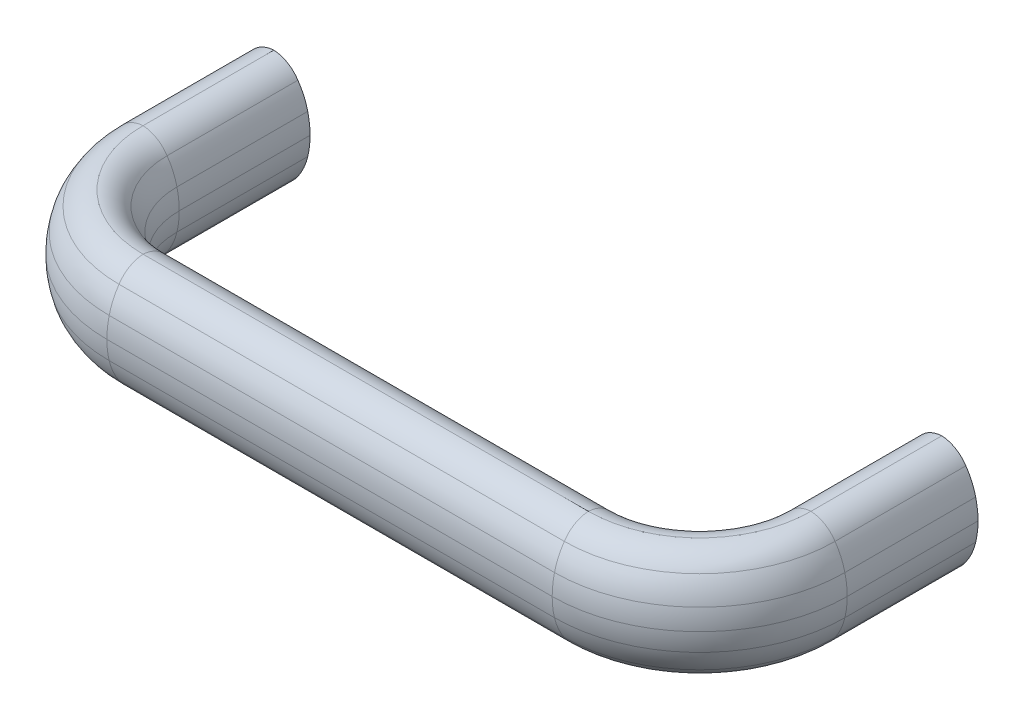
ISO-10303-21;
HEADER;
FILE_DESCRIPTION(('STEP AP214'),'2;1');
FILE_NAME('part.step','',(''),(''),'','','');
FILE_SCHEMA(('AUTOMOTIVE_DESIGN { 1 0 10303 214 1 1 1 1 }'));
ENDSEC;
DATA;
#1=APPLICATION_CONTEXT('core data for automotive mechanical design processes');
#2=APPLICATION_PROTOCOL_DEFINITION('international standard','automotive_design',2000,#1);
#3=PRODUCT_CONTEXT('',#1,'mechanical');
#4=PRODUCT('Part','Part','',(#3));
#5=PRODUCT_RELATED_PRODUCT_CATEGORY('part','',(#4));
#6=PRODUCT_DEFINITION_FORMATION('','',#4);
#7=PRODUCT_DEFINITION_CONTEXT('part definition',#1,'design');
#8=PRODUCT_DEFINITION('design','',#6,#7);
#9=PRODUCT_DEFINITION_SHAPE('','',#8);
#10=(LENGTH_UNIT() NAMED_UNIT(*) SI_UNIT(.MILLI.,.METRE.));
#11=(NAMED_UNIT(*) PLANE_ANGLE_UNIT() SI_UNIT($,.RADIAN.));
#12=(NAMED_UNIT(*) SI_UNIT($,.STERADIAN.) SOLID_ANGLE_UNIT());
#13=UNCERTAINTY_MEASURE_WITH_UNIT(LENGTH_MEASURE(1.E-05),#10,'distance_accuracy_value','');
#14=(GEOMETRIC_REPRESENTATION_CONTEXT(3) GLOBAL_UNCERTAINTY_ASSIGNED_CONTEXT((#13)) GLOBAL_UNIT_ASSIGNED_CONTEXT((#10,
#11,#12)) REPRESENTATION_CONTEXT('',''));
#15=CARTESIAN_POINT('',(0.,0.,0.));
#16=DIRECTION('',(0.,0.,1.));
#17=DIRECTION('',(1.,0.,0.));
#18=AXIS2_PLACEMENT_3D('',#15,#16,#17);
#19=CARTESIAN_POINT('',(111.596296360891,0.0233169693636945,23.5));
#20=DIRECTION('',(0.,0.,-1.));
#21=DIRECTION('',(0.,-1.,0.));
#22=AXIS2_PLACEMENT_3D('',#19,#20,#21);
#23=CYLINDRICAL_SURFACE('',#22,14.9037218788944);
#24=DIRECTION('',(0.,0.,1.));
#25=VECTOR('',#24,1.);
#26=CARTESIAN_POINT('',(126.085583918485,3.5135135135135,0.));
#27=LINE('',#26,#25);
#28=CARTESIAN_POINT('',(126.085583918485,3.51351351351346,0.));
#29=VERTEX_POINT('',#28);
#30=CARTESIAN_POINT('',(126.085583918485,3.5135135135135,23.5));
#31=VERTEX_POINT('',#30);
#32=EDGE_CURVE('E515',#29,#31,#27,.T.);
#33=ORIENTED_EDGE('',*,*,#32,.T.);
#34=CARTESIAN_POINT('',(111.596296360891,0.0233169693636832,23.5));
#35=DIRECTION('',(0.,0.,1.));
#36=DIRECTION('',(0.999998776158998,-0.00156450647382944,0.));
#37=AXIS2_PLACEMENT_3D('',#34,#35,#36);
#38=CIRCLE('',#37,14.9037218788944);
#39=CARTESIAN_POINT('',(126.5,0.,23.5));
#40=VERTEX_POINT('',#39);
#41=EDGE_CURVE('E21',#40,#31,#38,.T.);
#42=ORIENTED_EDGE('',*,*,#41,.F.);
#43=DIRECTION('',(0.,0.,1.));
#44=VECTOR('',#43,1.);
#45=CARTESIAN_POINT('',(126.5,0.,0.));
#46=LINE('',#45,#44);
#47=CARTESIAN_POINT('',(126.5,0.,0.));
#48=VERTEX_POINT('',#47);
#49=EDGE_CURVE('E643',#48,#40,#46,.T.);
#50=ORIENTED_EDGE('',*,*,#49,.F.);
#51=CARTESIAN_POINT('',(111.596296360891,0.0233169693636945,0.));
#52=DIRECTION('',(0.,0.,-1.));
#53=DIRECTION('',(0.972192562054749,0.234182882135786,0.));
#54=AXIS2_PLACEMENT_3D('',#51,#52,#53);
#55=CIRCLE('',#54,14.9037218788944);
#56=EDGE_CURVE('E524',#29,#48,#55,.T.);
#57=ORIENTED_EDGE('',*,*,#56,.F.);
#58=EDGE_LOOP('',(#33,#42,#50,#57));
#59=FACE_BOUND('',#58,.T.);
#60=ADVANCED_FACE('F14',(#59),#23,.T.);
#61=CARTESIAN_POINT('',(100.,0.0233169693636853,23.5));
#62=DIRECTION('',(0.,1.,0.));
#63=DIRECTION('',(1.,0.,0.));
#64=AXIS2_PLACEMENT_3D('',#61,#62,#63);
#65=DEGENERATE_TOROIDAL_SURFACE('',#64,11.5962963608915,14.9037218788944,.T.);
#66=CARTESIAN_POINT('',(100.,3.5135135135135,23.5));
#67=DIRECTION('',(0.,-1.,0.));
#68=DIRECTION('',(1.,0.,0.));
#69=AXIS2_PLACEMENT_3D('',#66,#67,#68);
#70=CIRCLE('',#69,26.0855839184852);
#71=CARTESIAN_POINT('',(100.,3.51351351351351,49.5855839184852));
#72=VERTEX_POINT('',#71);
#73=EDGE_CURVE('E505',#31,#72,#70,.T.);
#74=ORIENTED_EDGE('',*,*,#73,.T.);
#75=CARTESIAN_POINT('',(100.,0.0233169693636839,35.0962963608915));
#76=DIRECTION('',(1.,0.,0.));
#77=DIRECTION('',(0.,0.234182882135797,0.972192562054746));
#78=AXIS2_PLACEMENT_3D('',#75,#76,#77);
#79=CIRCLE('',#78,14.9037218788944);
#80=CARTESIAN_POINT('',(100.,0.,50.));
#81=VERTEX_POINT('',#80);
#82=EDGE_CURVE('E467',#72,#81,#79,.T.);
#83=ORIENTED_EDGE('',*,*,#82,.T.);
#84=CARTESIAN_POINT('',(100.,0.,23.5));
#85=DIRECTION('',(0.,-1.,0.));
#86=DIRECTION('',(1.,0.,0.));
#87=AXIS2_PLACEMENT_3D('',#84,#85,#86);
#88=CIRCLE('',#87,26.5);
#89=EDGE_CURVE('E646',#40,#81,#88,.T.);
#90=ORIENTED_EDGE('',*,*,#89,.F.);
#91=ORIENTED_EDGE('',*,*,#41,.T.);
#92=EDGE_LOOP('',(#74,#83,#90,#91));
#93=FACE_BOUND('',#92,.T.);
#94=ADVANCED_FACE('F663',(#93),#65,.T.);
#95=CARTESIAN_POINT('',(100.,-0.0233169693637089,23.5));
#96=DIRECTION('',(0.,1.,0.));
#97=DIRECTION('',(1.,0.,0.));
#98=AXIS2_PLACEMENT_3D('',#95,#96,#97);
#99=DEGENERATE_TOROIDAL_SURFACE('',#98,11.5962963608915,14.9037218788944,.T.);
#100=ORIENTED_EDGE('',*,*,#89,.T.);
#101=CARTESIAN_POINT('',(100.,-0.0233169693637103,35.0962963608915));
#102=DIRECTION('',(1.,0.,0.));
#103=DIRECTION('',(0.,0.00156450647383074,0.999998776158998));
#104=AXIS2_PLACEMENT_3D('',#101,#102,#103);
#105=CIRCLE('',#104,14.9037218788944);
#106=CARTESIAN_POINT('',(100.,-3.51351351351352,49.5855839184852));
#107=VERTEX_POINT('',#106);
#108=EDGE_CURVE('E471',#81,#107,#105,.T.);
#109=ORIENTED_EDGE('',*,*,#108,.T.);
#110=CARTESIAN_POINT('',(100.,-3.51351351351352,23.5));
#111=DIRECTION('',(0.,1.,0.));
#112=DIRECTION('',(0.,0.,1.));
#113=AXIS2_PLACEMENT_3D('',#110,#111,#112);
#114=CIRCLE('',#113,26.0855839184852);
#115=CARTESIAN_POINT('',(126.085583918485,-3.51351351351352,23.5));
#116=VERTEX_POINT('',#115);
#117=EDGE_CURVE('E637',#107,#116,#114,.T.);
#118=ORIENTED_EDGE('',*,*,#117,.T.);
#119=CARTESIAN_POINT('',(111.596296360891,-0.023316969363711,23.5));
#120=DIRECTION('',(0.,0.,1.));
#121=DIRECTION('',(0.972192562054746,-0.234182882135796,0.));
#122=AXIS2_PLACEMENT_3D('',#119,#120,#121);
#123=CIRCLE('',#122,14.9037218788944);
#124=EDGE_CURVE('E642',#116,#40,#123,.T.);
#125=ORIENTED_EDGE('',*,*,#124,.T.);
#126=EDGE_LOOP('',(#100,#109,#118,#125));
#127=FACE_BOUND('',#126,.T.);
#128=ADVANCED_FACE('F680',(#127),#99,.T.);
#129=CARTESIAN_POINT('',(111.596296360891,-0.0233169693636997,23.5));
#130=DIRECTION('',(0.,0.,-1.));
#131=DIRECTION('',(0.,-1.,0.));
#132=AXIS2_PLACEMENT_3D('',#129,#130,#131);
#133=CYLINDRICAL_SURFACE('',#132,14.9037218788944);
#134=ORIENTED_EDGE('',*,*,#49,.T.);
#135=ORIENTED_EDGE('',*,*,#124,.F.);
#136=DIRECTION('',(0.,0.,1.));
#137=VECTOR('',#136,1.);
#138=CARTESIAN_POINT('',(126.085583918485,-3.51351351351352,0.));
#139=LINE('',#138,#137);
#140=CARTESIAN_POINT('',(126.085583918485,-3.51351351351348,0.));
#141=VERTEX_POINT('',#140);
#142=EDGE_CURVE('E639',#141,#116,#139,.T.);
#143=ORIENTED_EDGE('',*,*,#142,.F.);
#144=CARTESIAN_POINT('',(111.596296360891,-0.0233169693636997,0.));
#145=DIRECTION('',(0.,0.,-1.));
#146=DIRECTION('',(0.999998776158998,0.00156450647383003,0.));
#147=AXIS2_PLACEMENT_3D('',#144,#145,#146);
#148=CIRCLE('',#147,14.9037218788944);
#149=EDGE_CURVE('E521',#48,#141,#148,.T.);
#150=ORIENTED_EDGE('',*,*,#149,.F.);
#151=EDGE_LOOP('',(#134,#135,#143,#150));
#152=FACE_BOUND('',#151,.T.);
#153=ADVANCED_FACE('F748',(#152),#133,.T.);
#154=CARTESIAN_POINT('',(115.044200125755,-0.961217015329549,23.5));
#155=DIRECTION('',(0.,0.,-1.));
#156=DIRECTION('',(0.,-1.,0.));
#157=AXIS2_PLACEMENT_3D('',#154,#155,#156);
#158=CYLINDRICAL_SURFACE('',#157,11.3325360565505);
#159=ORIENTED_EDGE('',*,*,#142,.T.);
#160=CARTESIAN_POINT('',(115.044200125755,-0.961217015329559,23.5));
#161=DIRECTION('',(0.,0.,1.));
#162=DIRECTION('',(0.818208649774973,-0.57492139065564,0.));
#163=AXIS2_PLACEMENT_3D('',#160,#161,#162);
#164=CIRCLE('',#163,11.3325360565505);
#165=CARTESIAN_POINT('',(124.316579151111,-7.47653440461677,23.5));
#166=VERTEX_POINT('',#165);
#167=EDGE_CURVE('E634',#166,#116,#164,.T.);
#168=ORIENTED_EDGE('',*,*,#167,.F.);
#169=DIRECTION('',(0.,0.,1.));
#170=VECTOR('',#169,1.);
#171=CARTESIAN_POINT('',(124.316579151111,-7.47653440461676,0.));
#172=LINE('',#171,#170);
#173=CARTESIAN_POINT('',(124.316579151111,-7.47653440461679,0.));
#174=VERTEX_POINT('',#173);
#175=EDGE_CURVE('E557',#174,#166,#172,.T.);
#176=ORIENTED_EDGE('',*,*,#175,.F.);
#177=CARTESIAN_POINT('',(115.044200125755,-0.961217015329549,0.));
#178=DIRECTION('',(0.,0.,-1.));
#179=DIRECTION('',(0.974308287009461,-0.225218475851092,0.));
#180=AXIS2_PLACEMENT_3D('',#177,#178,#179);
#181=CIRCLE('',#180,11.3325360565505);
#182=EDGE_CURVE('E518',#141,#174,#181,.T.);
#183=ORIENTED_EDGE('',*,*,#182,.F.);
#184=EDGE_LOOP('',(#159,#168,#176,#183));
#185=FACE_BOUND('',#184,.T.);
#186=ADVANCED_FACE('F745',(#185),#158,.T.);
#187=CARTESIAN_POINT('',(100.,-0.961217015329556,23.5));
#188=DIRECTION('',(0.,1.,0.));
#189=DIRECTION('',(1.,0.,0.));
#190=AXIS2_PLACEMENT_3D('',#187,#188,#189);
#191=TOROIDAL_SURFACE('',#190,15.0442001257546,11.3325360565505);
#192=ORIENTED_EDGE('',*,*,#117,.F.);
#193=CARTESIAN_POINT('',(100.,-0.961217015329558,38.5442001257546));
#194=DIRECTION('',(1.,0.,0.));
#195=DIRECTION('',(0.,-0.225218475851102,0.974308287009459));
#196=AXIS2_PLACEMENT_3D('',#193,#194,#195);
#197=CIRCLE('',#196,11.3325360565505);
#198=CARTESIAN_POINT('',(100.,-7.47653440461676,47.816579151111));
#199=VERTEX_POINT('',#198);
#200=EDGE_CURVE('E474',#107,#199,#197,.T.);
#201=ORIENTED_EDGE('',*,*,#200,.T.);
#202=CARTESIAN_POINT('',(100.,-7.47653440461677,23.5));
#203=DIRECTION('',(0.,-1.,0.));
#204=DIRECTION('',(1.,0.,0.));
#205=AXIS2_PLACEMENT_3D('',#202,#203,#204);
#206=CIRCLE('',#205,24.316579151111);
#207=EDGE_CURVE('E628',#166,#199,#206,.T.);
#208=ORIENTED_EDGE('',*,*,#207,.F.);
#209=ORIENTED_EDGE('',*,*,#167,.T.);
#210=EDGE_LOOP('',(#192,#201,#208,#209));
#211=FACE_BOUND('',#210,.T.);
#212=ADVANCED_FACE('F694',(#211),#191,.T.);
#213=CARTESIAN_POINT('',(100.,-4.49051001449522,23.5));
#214=DIRECTION('',(0.,1.,0.));
#215=DIRECTION('',(1.,0.,0.));
#216=AXIS2_PLACEMENT_3D('',#213,#214,#215);
#217=TOROIDAL_SURFACE('',#216,19.6750571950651,5.51906402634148);
#218=ORIENTED_EDGE('',*,*,#207,.T.);
#219=CARTESIAN_POINT('',(100.,-4.49051001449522,43.1750571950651));
#220=DIRECTION('',(1.,0.,0.));
#221=DIRECTION('',(0.,-0.541038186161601,0.8409980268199));
#222=AXIS2_PLACEMENT_3D('',#219,#220,#221);
#223=CIRCLE('',#222,5.51906402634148);
#224=CARTESIAN_POINT('',(100.,-10.,43.5));
#225=VERTEX_POINT('',#224);
#226=EDGE_CURVE('E477',#199,#225,#223,.T.);
#227=ORIENTED_EDGE('',*,*,#226,.T.);
#228=CARTESIAN_POINT('',(100.,-10.,23.5));
#229=DIRECTION('',(0.,-1.,0.));
#230=DIRECTION('',(1.,0.,0.));
#231=AXIS2_PLACEMENT_3D('',#228,#229,#230);
#232=CIRCLE('',#231,20.);
#233=CARTESIAN_POINT('',(120.,-10.,23.5));
#234=VERTEX_POINT('',#233);
#235=EDGE_CURVE('E622',#234,#225,#232,.T.);
#236=ORIENTED_EDGE('',*,*,#235,.F.);
#237=CARTESIAN_POINT('',(119.675057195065,-4.49051001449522,23.5));
#238=DIRECTION('',(0.,0.,1.));
#239=DIRECTION('',(0.0588764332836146,-0.99826527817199,0.));
#240=AXIS2_PLACEMENT_3D('',#237,#238,#239);
#241=CIRCLE('',#240,5.51906402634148);
#242=EDGE_CURVE('E556',#234,#166,#241,.T.);
#243=ORIENTED_EDGE('',*,*,#242,.T.);
#244=EDGE_LOOP('',(#218,#227,#236,#243));
#245=FACE_BOUND('',#244,.T.);
#246=ADVANCED_FACE('F697',(#245),#217,.T.);
#247=CARTESIAN_POINT('',(100.,-4.49051001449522,23.5));
#248=DIRECTION('',(0.,1.,0.));
#249=DIRECTION('',(1.,0.,0.));
#250=AXIS2_PLACEMENT_3D('',#247,#248,#249);
#251=TOROIDAL_SURFACE('',#250,20.3249428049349,5.51906402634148);
#252=ORIENTED_EDGE('',*,*,#235,.T.);
#253=CARTESIAN_POINT('',(100.,-4.49051001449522,43.8249428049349));
#254=DIRECTION('',(1.,0.,0.));
#255=DIRECTION('',(0.,-0.99826527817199,-0.0588764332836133));
#256=AXIS2_PLACEMENT_3D('',#253,#254,#255);
#257=CIRCLE('',#256,5.51906402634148);
#258=CARTESIAN_POINT('',(100.,-7.47653440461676,39.183420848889));
#259=VERTEX_POINT('',#258);
#260=EDGE_CURVE('E480',#225,#259,#257,.T.);
#261=ORIENTED_EDGE('',*,*,#260,.T.);
#262=CARTESIAN_POINT('',(100.,-7.47653440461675,23.5));
#263=DIRECTION('',(0.,-1.,0.));
#264=DIRECTION('',(1.,0.,0.));
#265=AXIS2_PLACEMENT_3D('',#262,#263,#264);
#266=CIRCLE('',#265,15.683420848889);
#267=CARTESIAN_POINT('',(115.683420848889,-7.47653440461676,23.5));
#268=VERTEX_POINT('',#267);
#269=EDGE_CURVE('E614',#268,#259,#266,.T.);
#270=ORIENTED_EDGE('',*,*,#269,.F.);
#271=CARTESIAN_POINT('',(120.324942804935,-4.49051001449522,23.5));
#272=DIRECTION('',(0.,0.,1.));
#273=DIRECTION('',(-0.840998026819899,-0.541038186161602,0.));
#274=AXIS2_PLACEMENT_3D('',#271,#272,#273);
#275=CIRCLE('',#274,5.51906402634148);
#276=EDGE_CURVE('E563',#268,#234,#275,.T.);
#277=ORIENTED_EDGE('',*,*,#276,.T.);
#278=EDGE_LOOP('',(#252,#261,#270,#277));
#279=FACE_BOUND('',#278,.T.);
#280=ADVANCED_FACE('F710',(#279),#251,.T.);
#281=CARTESIAN_POINT('',(100.,-0.961217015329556,23.5));
#282=DIRECTION('',(0.,1.,0.));
#283=DIRECTION('',(1.,0.,0.));
#284=AXIS2_PLACEMENT_3D('',#281,#282,#283);
#285=TOROIDAL_SURFACE('',#284,24.9557998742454,11.3325360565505);
#286=ORIENTED_EDGE('',*,*,#269,.T.);
#287=CARTESIAN_POINT('',(100.,-0.961217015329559,48.4557998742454));
#288=DIRECTION('',(1.,0.,0.));
#289=DIRECTION('',(0.,-0.57492139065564,-0.818208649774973));
#290=AXIS2_PLACEMENT_3D('',#287,#288,#289);
#291=CIRCLE('',#290,11.3325360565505);
#292=CARTESIAN_POINT('',(100.,-3.51351351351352,37.4144160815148));
#293=VERTEX_POINT('',#292);
#294=EDGE_CURVE('E483',#259,#293,#291,.T.);
#295=ORIENTED_EDGE('',*,*,#294,.T.);
#296=CARTESIAN_POINT('',(100.,-3.51351351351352,23.5));
#297=DIRECTION('',(0.,-1.,0.));
#298=DIRECTION('',(1.,0.,0.));
#299=AXIS2_PLACEMENT_3D('',#296,#297,#298);
#300=CIRCLE('',#299,13.9144160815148);
#301=CARTESIAN_POINT('',(113.914416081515,-3.51351351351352,23.5));
#302=VERTEX_POINT('',#301);
#303=EDGE_CURVE('E606',#302,#293,#300,.T.);
#304=ORIENTED_EDGE('',*,*,#303,.F.);
#305=CARTESIAN_POINT('',(124.955799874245,-0.961217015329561,23.5));
#306=DIRECTION('',(0.,0.,1.));
#307=DIRECTION('',(-0.974308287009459,-0.225218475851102,0.));
#308=AXIS2_PLACEMENT_3D('',#305,#306,#307);
#309=CIRCLE('',#308,11.3325360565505);
#310=EDGE_CURVE('E567',#302,#268,#309,.T.);
#311=ORIENTED_EDGE('',*,*,#310,.T.);
#312=EDGE_LOOP('',(#286,#295,#304,#311));
#313=FACE_BOUND('',#312,.T.);
#314=ADVANCED_FACE('F713',(#313),#285,.T.);
#315=CARTESIAN_POINT('',(100.,-0.0233169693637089,23.5));
#316=DIRECTION('',(0.,1.,0.));
#317=DIRECTION('',(1.,0.,0.));
#318=AXIS2_PLACEMENT_3D('',#315,#316,#317);
#319=TOROIDAL_SURFACE('',#318,28.4037036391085,14.9037218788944);
#320=CARTESIAN_POINT('',(128.403703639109,-0.0233169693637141,23.5));
#321=DIRECTION('',(0.,0.,1.));
#322=DIRECTION('',(-1.,0.,0.));
#323=AXIS2_PLACEMENT_3D('',#320,#321,#322);
#324=CIRCLE('',#323,14.9037218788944);
#325=CARTESIAN_POINT('',(113.499981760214,-0.0233169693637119,23.5));
#326=VERTEX_POINT('',#325);
#327=EDGE_CURVE('E576',#326,#302,#324,.T.);
#328=ORIENTED_EDGE('',*,*,#327,.T.);
#329=ORIENTED_EDGE('',*,*,#303,.T.);
#330=CARTESIAN_POINT('',(100.,-0.0233169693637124,51.9037036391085));
#331=DIRECTION('',(1.,0.,0.));
#332=DIRECTION('',(0.,-0.234182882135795,-0.972192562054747));
#333=AXIS2_PLACEMENT_3D('',#330,#331,#332);
#334=CIRCLE('',#333,14.9037218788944);
#335=CARTESIAN_POINT('',(100.,-0.0233169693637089,36.9999817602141));
#336=VERTEX_POINT('',#335);
#337=EDGE_CURVE('E486',#293,#336,#334,.T.);
#338=ORIENTED_EDGE('',*,*,#337,.T.);
#339=DIRECTION('',(0.,0.999999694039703,0.000782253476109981));
#340=VECTOR('',#339,1.);
#341=CARTESIAN_POINT('',(100.,-0.0233169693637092,36.9999817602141));
#342=LINE('',#341,#340);
#343=CARTESIAN_POINT('',(100.,0.,37.));
#344=VERTEX_POINT('',#343);
#345=EDGE_CURVE('E490',#336,#344,#342,.T.);
#346=ORIENTED_EDGE('',*,*,#345,.T.);
#347=CARTESIAN_POINT('',(100.,0.,23.5));
#348=DIRECTION('',(0.,-1.,0.));
#349=DIRECTION('',(1.,0.,0.));
#350=AXIS2_PLACEMENT_3D('',#347,#348,#349);
#351=CIRCLE('',#350,13.5);
#352=CARTESIAN_POINT('',(113.5,0.,23.5));
#353=VERTEX_POINT('',#352);
#354=EDGE_CURVE('E600',#353,#344,#351,.T.);
#355=ORIENTED_EDGE('',*,*,#354,.F.);
#356=DIRECTION('',(-0.000782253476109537,-0.999999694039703,0.));
#357=VECTOR('',#356,1.);
#358=CARTESIAN_POINT('',(113.5,0.,23.5));
#359=LINE('',#358,#357);
#360=EDGE_CURVE('E571',#353,#326,#359,.T.);
#361=ORIENTED_EDGE('',*,*,#360,.T.);
#362=EDGE_LOOP('',(#328,#329,#338,#346,#355,#361));
#363=FACE_BOUND('',#362,.T.);
#364=ADVANCED_FACE('F726',(#363),#319,.T.);
#365=CARTESIAN_POINT('',(100.,0.0233169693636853,23.5));
#366=DIRECTION('',(0.,1.,0.));
#367=DIRECTION('',(1.,0.,0.));
#368=AXIS2_PLACEMENT_3D('',#365,#366,#367);
#369=TOROIDAL_SURFACE('',#368,28.4037036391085,14.9037218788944);
#370=DIRECTION('',(0.000782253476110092,-0.999999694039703,0.));
#371=VECTOR('',#370,1.);
#372=CARTESIAN_POINT('',(113.499981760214,0.0233169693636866,23.5));
#373=LINE('',#372,#371);
#374=CARTESIAN_POINT('',(113.499981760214,0.0233169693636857,23.5));
#375=VERTEX_POINT('',#374);
#376=EDGE_CURVE('E581',#375,#353,#373,.T.);
#377=ORIENTED_EDGE('',*,*,#376,.T.);
#378=ORIENTED_EDGE('',*,*,#354,.T.);
#379=DIRECTION('',(0.,0.999999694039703,-0.000782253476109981));
#380=VECTOR('',#379,1.);
#381=CARTESIAN_POINT('',(100.,0.,37.));
#382=LINE('',#381,#380);
#383=CARTESIAN_POINT('',(100.,0.0233169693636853,36.9999817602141));
#384=VERTEX_POINT('',#383);
#385=EDGE_CURVE('E489',#344,#384,#382,.T.);
#386=ORIENTED_EDGE('',*,*,#385,.T.);
#387=CARTESIAN_POINT('',(100.,0.0233169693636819,51.9037036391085));
#388=DIRECTION('',(1.,0.,0.));
#389=DIRECTION('',(0.,0.,-1.));
#390=AXIS2_PLACEMENT_3D('',#387,#388,#389);
#391=CIRCLE('',#390,14.9037218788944);
#392=CARTESIAN_POINT('',(100.,3.5135135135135,37.4144160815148));
#393=VERTEX_POINT('',#392);
#394=EDGE_CURVE('E498',#384,#393,#391,.T.);
#395=ORIENTED_EDGE('',*,*,#394,.T.);
#396=CARTESIAN_POINT('',(100.,3.5135135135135,23.5));
#397=DIRECTION('',(0.,-1.,0.));
#398=DIRECTION('',(1.,0.,0.));
#399=AXIS2_PLACEMENT_3D('',#396,#397,#398);
#400=CIRCLE('',#399,13.9144160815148);
#401=CARTESIAN_POINT('',(113.914416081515,3.51351351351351,23.5));
#402=VERTEX_POINT('',#401);
#403=EDGE_CURVE('E596',#402,#393,#400,.T.);
#404=ORIENTED_EDGE('',*,*,#403,.F.);
#405=CARTESIAN_POINT('',(128.403703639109,0.0233169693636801,23.5));
#406=DIRECTION('',(0.,0.,1.));
#407=DIRECTION('',(-0.972192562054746,0.234182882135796,0.));
#408=AXIS2_PLACEMENT_3D('',#405,#406,#407);
#409=CIRCLE('',#408,14.9037218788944);
#410=EDGE_CURVE('E575',#402,#375,#409,.T.);
#411=ORIENTED_EDGE('',*,*,#410,.T.);
#412=EDGE_LOOP('',(#377,#378,#386,#395,#404,#411));
#413=FACE_BOUND('',#412,.T.);
#414=ADVANCED_FACE('F823',(#413),#369,.T.);
#415=CARTESIAN_POINT('',(100.,0.961217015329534,23.5));
#416=DIRECTION('',(0.,1.,0.));
#417=DIRECTION('',(1.,0.,0.));
#418=AXIS2_PLACEMENT_3D('',#415,#416,#417);
#419=TOROIDAL_SURFACE('',#418,24.9557998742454,11.3325360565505);
#420=ORIENTED_EDGE('',*,*,#403,.T.);
#421=CARTESIAN_POINT('',(100.,0.961217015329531,48.4557998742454));
#422=DIRECTION('',(1.,0.,0.));
#423=DIRECTION('',(0.,0.225218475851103,-0.974308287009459));
#424=AXIS2_PLACEMENT_3D('',#421,#422,#423);
#425=CIRCLE('',#424,11.3325360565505);
#426=CARTESIAN_POINT('',(100.,7.47653440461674,39.183420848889));
#427=VERTEX_POINT('',#426);
#428=EDGE_CURVE('E495',#393,#427,#425,.T.);
#429=ORIENTED_EDGE('',*,*,#428,.T.);
#430=CARTESIAN_POINT('',(100.,7.47653440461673,23.5));
#431=DIRECTION('',(0.,1.,0.));
#432=DIRECTION('',(0.,0.,1.));
#433=AXIS2_PLACEMENT_3D('',#430,#431,#432);
#434=CIRCLE('',#433,15.683420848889);
#435=CARTESIAN_POINT('',(115.683420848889,7.47653440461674,23.5));
#436=VERTEX_POINT('',#435);
#437=EDGE_CURVE('E590',#427,#436,#434,.T.);
#438=ORIENTED_EDGE('',*,*,#437,.T.);
#439=CARTESIAN_POINT('',(124.955799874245,0.961217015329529,23.5));
#440=DIRECTION('',(0.,0.,1.));
#441=DIRECTION('',(-0.818208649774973,0.574921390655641,0.));
#442=AXIS2_PLACEMENT_3D('',#439,#440,#441);
#443=CIRCLE('',#442,11.3325360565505);
#444=EDGE_CURVE('E580',#436,#402,#443,.T.);
#445=ORIENTED_EDGE('',*,*,#444,.T.);
#446=EDGE_LOOP('',(#420,#429,#438,#445));
#447=FACE_BOUND('',#446,.T.);
#448=ADVANCED_FACE('F798',(#447),#419,.T.);
#449=CARTESIAN_POINT('',(100.,4.4905100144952,23.5));
#450=DIRECTION('',(0.,1.,0.));
#451=DIRECTION('',(1.,0.,0.));
#452=AXIS2_PLACEMENT_3D('',#449,#450,#451);
#453=TOROIDAL_SURFACE('',#452,20.3249428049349,5.51906402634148);
#454=ORIENTED_EDGE('',*,*,#437,.F.);
#455=CARTESIAN_POINT('',(100.,4.49051001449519,43.8249428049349));
#456=DIRECTION('',(1.,0.,0.));
#457=DIRECTION('',(0.,0.541038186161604,-0.840998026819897));
#458=AXIS2_PLACEMENT_3D('',#455,#456,#457);
#459=CIRCLE('',#458,5.51906402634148);
#460=CARTESIAN_POINT('',(100.,10.,43.5));
#461=VERTEX_POINT('',#460);
#462=EDGE_CURVE('E494',#427,#461,#459,.T.);
#463=ORIENTED_EDGE('',*,*,#462,.T.);
#464=CARTESIAN_POINT('',(100.,10.,23.5));
#465=DIRECTION('',(0.,-1.,0.));
#466=DIRECTION('',(1.,0.,0.));
#467=AXIS2_PLACEMENT_3D('',#464,#465,#466);
#468=CIRCLE('',#467,20.);
#469=CARTESIAN_POINT('',(120.,10.,23.5));
#470=VERTEX_POINT('',#469);
#471=EDGE_CURVE('E36',#470,#461,#468,.T.);
#472=ORIENTED_EDGE('',*,*,#471,.F.);
#473=CARTESIAN_POINT('',(120.324942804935,4.49051001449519,23.5));
#474=DIRECTION('',(0.,0.,1.));
#475=DIRECTION('',(-0.0588764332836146,0.99826527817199,0.));
#476=AXIS2_PLACEMENT_3D('',#473,#474,#475);
#477=CIRCLE('',#476,5.51906402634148);
#478=EDGE_CURVE('E585',#470,#436,#477,.T.);
#479=ORIENTED_EDGE('',*,*,#478,.T.);
#480=EDGE_LOOP('',(#454,#463,#472,#479));
#481=FACE_BOUND('',#480,.T.);
#482=ADVANCED_FACE('F760',(#481),#453,.T.);
#483=CARTESIAN_POINT('',(100.,4.4905100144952,23.5));
#484=DIRECTION('',(0.,1.,0.));
#485=DIRECTION('',(1.,0.,0.));
#486=AXIS2_PLACEMENT_3D('',#483,#484,#485);
#487=TOROIDAL_SURFACE('',#486,19.6750571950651,5.51906402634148);
#488=ORIENTED_EDGE('',*,*,#471,.T.);
#489=CARTESIAN_POINT('',(100.,4.49051001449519,43.1750571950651));
#490=DIRECTION('',(1.,0.,0.));
#491=DIRECTION('',(0.,0.99826527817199,0.0588764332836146));
#492=AXIS2_PLACEMENT_3D('',#489,#490,#491);
#493=CIRCLE('',#492,5.51906402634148);
#494=CARTESIAN_POINT('',(100.,7.47653440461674,47.816579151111));
#495=VERTEX_POINT('',#494);
#496=EDGE_CURVE('E501',#461,#495,#493,.T.);
#497=ORIENTED_EDGE('',*,*,#496,.T.);
#498=CARTESIAN_POINT('',(100.,7.47653440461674,23.5));
#499=DIRECTION('',(0.,-1.,0.));
#500=DIRECTION('',(1.,0.,0.));
#501=AXIS2_PLACEMENT_3D('',#498,#499,#500);
#502=CIRCLE('',#501,24.316579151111);
#503=CARTESIAN_POINT('',(124.316579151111,7.47653440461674,23.5));
#504=VERTEX_POINT('',#503);
#505=EDGE_CURVE('E28',#504,#495,#502,.T.);
#506=ORIENTED_EDGE('',*,*,#505,.F.);
#507=CARTESIAN_POINT('',(119.675057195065,4.49051001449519,23.5));
#508=DIRECTION('',(0.,0.,1.));
#509=DIRECTION('',(0.840998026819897,0.541038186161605,0.));
#510=AXIS2_PLACEMENT_3D('',#507,#508,#509);
#511=CIRCLE('',#510,5.51906402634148);
#512=EDGE_CURVE('E586',#504,#470,#511,.T.);
#513=ORIENTED_EDGE('',*,*,#512,.T.);
#514=EDGE_LOOP('',(#488,#497,#506,#513));
#515=FACE_BOUND('',#514,.T.);
#516=ADVANCED_FACE('F789',(#515),#487,.T.);
#517=CARTESIAN_POINT('',(119.675057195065,4.4905100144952,23.5));
#518=DIRECTION('',(0.,0.,-1.));
#519=DIRECTION('',(0.,-1.,0.));
#520=AXIS2_PLACEMENT_3D('',#517,#518,#519);
#521=CYLINDRICAL_SURFACE('',#520,5.51906402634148);
#522=DIRECTION('',(0.,0.,1.));
#523=VECTOR('',#522,1.);
#524=CARTESIAN_POINT('',(120.,10.,0.));
#525=LINE('',#524,#523);
#526=CARTESIAN_POINT('',(120.,10.,0.));
#527=VERTEX_POINT('',#526);
#528=EDGE_CURVE('E582',#527,#470,#525,.T.);
#529=ORIENTED_EDGE('',*,*,#528,.T.);
#530=ORIENTED_EDGE('',*,*,#512,.F.);
#531=DIRECTION('',(0.,0.,1.));
#532=VECTOR('',#531,1.);
#533=CARTESIAN_POINT('',(124.316579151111,7.47653440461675,0.));
#534=LINE('',#533,#532);
#535=CARTESIAN_POINT('',(124.316579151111,7.47653440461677,0.));
#536=VERTEX_POINT('',#535);
#537=EDGE_CURVE('E511',#536,#504,#534,.T.);
#538=ORIENTED_EDGE('',*,*,#537,.F.);
#539=CARTESIAN_POINT('',(119.675057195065,4.4905100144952,0.));
#540=DIRECTION('',(0.,0.,-1.));
#541=DIRECTION('',(0.0588764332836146,0.99826527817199,0.));
#542=AXIS2_PLACEMENT_3D('',#539,#540,#541);
#543=CIRCLE('',#542,5.51906402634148);
#544=EDGE_CURVE('E527',#527,#536,#543,.T.);
#545=ORIENTED_EDGE('',*,*,#544,.F.);
#546=EDGE_LOOP('',(#529,#530,#538,#545));
#547=FACE_BOUND('',#546,.T.);
#548=ADVANCED_FACE('F753',(#547),#521,.T.);
#549=CARTESIAN_POINT('',(120.324942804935,4.4905100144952,23.5));
#550=DIRECTION('',(0.,0.,-1.));
#551=DIRECTION('',(0.,-1.,0.));
#552=AXIS2_PLACEMENT_3D('',#549,#550,#551);
#553=CYLINDRICAL_SURFACE('',#552,5.51906402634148);
#554=DIRECTION('',(0.,0.,1.));
#555=VECTOR('',#554,1.);
#556=CARTESIAN_POINT('',(115.683420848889,7.47653440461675,0.));
#557=LINE('',#556,#555);
#558=CARTESIAN_POINT('',(115.683420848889,7.47653440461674,0.));
#559=VERTEX_POINT('',#558);
#560=EDGE_CURVE('E577',#559,#436,#557,.T.);
#561=ORIENTED_EDGE('',*,*,#560,.T.);
#562=ORIENTED_EDGE('',*,*,#478,.F.);
#563=ORIENTED_EDGE('',*,*,#528,.F.);
#564=CARTESIAN_POINT('',(120.324942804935,4.4905100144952,0.));
#565=DIRECTION('',(0.,0.,-1.));
#566=DIRECTION('',(-0.840998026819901,0.5410381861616,0.));
#567=AXIS2_PLACEMENT_3D('',#564,#565,#566);
#568=CIRCLE('',#567,5.51906402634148);
#569=EDGE_CURVE('E532',#559,#527,#568,.T.);
#570=ORIENTED_EDGE('',*,*,#569,.F.);
#571=EDGE_LOOP('',(#561,#562,#563,#570));
#572=FACE_BOUND('',#571,.T.);
#573=ADVANCED_FACE('F756',(#572),#553,.T.);
#574=CARTESIAN_POINT('',(124.955799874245,0.961217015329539,23.5));
#575=DIRECTION('',(0.,0.,-1.));
#576=DIRECTION('',(0.,-1.,0.));
#577=AXIS2_PLACEMENT_3D('',#574,#575,#576);
#578=CYLINDRICAL_SURFACE('',#577,11.3325360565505);
#579=DIRECTION('',(0.,0.,1.));
#580=VECTOR('',#579,1.);
#581=CARTESIAN_POINT('',(113.914416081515,3.51351351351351,0.));
#582=LINE('',#581,#580);
#583=CARTESIAN_POINT('',(113.914416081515,3.51351351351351,0.));
#584=VERTEX_POINT('',#583);
#585=EDGE_CURVE('E572',#584,#402,#582,.T.);
#586=ORIENTED_EDGE('',*,*,#585,.T.);
#587=ORIENTED_EDGE('',*,*,#444,.F.);
#588=ORIENTED_EDGE('',*,*,#560,.F.);
#589=CARTESIAN_POINT('',(124.955799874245,0.961217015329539,0.));
#590=DIRECTION('',(0.,0.,-1.));
#591=DIRECTION('',(-0.974308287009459,0.225218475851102,0.));
#592=AXIS2_PLACEMENT_3D('',#589,#590,#591);
#593=CIRCLE('',#592,11.3325360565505);
#594=EDGE_CURVE('E535',#584,#559,#593,.T.);
#595=ORIENTED_EDGE('',*,*,#594,.F.);
#596=EDGE_LOOP('',(#586,#587,#588,#595));
#597=FACE_BOUND('',#596,.T.);
#598=ADVANCED_FACE('F976',(#597),#578,.T.);
#599=CARTESIAN_POINT('',(128.403703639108,0.0233169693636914,23.5));
#600=DIRECTION('',(0.,0.,-1.));
#601=DIRECTION('',(0.,-1.,0.));
#602=AXIS2_PLACEMENT_3D('',#599,#600,#601);
#603=CYLINDRICAL_SURFACE('',#602,14.9037218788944);
#604=DIRECTION('',(0.,0.,1.));
#605=VECTOR('',#604,1.);
#606=CARTESIAN_POINT('',(113.5,0.,0.));
#607=LINE('',#606,#605);
#608=CARTESIAN_POINT('',(113.5,0.,0.));
#609=VERTEX_POINT('',#608);
#610=EDGE_CURVE('E568',#609,#353,#607,.T.);
#611=ORIENTED_EDGE('',*,*,#610,.T.);
#612=ORIENTED_EDGE('',*,*,#376,.F.);
#613=ORIENTED_EDGE('',*,*,#410,.F.);
#614=ORIENTED_EDGE('',*,*,#585,.F.);
#615=CARTESIAN_POINT('',(128.403703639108,0.0233169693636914,0.));
#616=DIRECTION('',(0.,0.,-1.));
#617=DIRECTION('',(-0.999998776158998,-0.00156450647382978,0.));
#618=AXIS2_PLACEMENT_3D('',#615,#616,#617);
#619=CIRCLE('',#618,14.9037218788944);
#620=EDGE_CURVE('E538',#609,#584,#619,.T.);
#621=ORIENTED_EDGE('',*,*,#620,.F.);
#622=EDGE_LOOP('',(#611,#612,#613,#614,#621));
#623=FACE_BOUND('',#622,.T.);
#624=ADVANCED_FACE('F973',(#623),#603,.T.);
#625=CARTESIAN_POINT('',(128.403703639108,-0.0233169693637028,23.5));
#626=DIRECTION('',(0.,0.,-1.));
#627=DIRECTION('',(0.,-1.,0.));
#628=AXIS2_PLACEMENT_3D('',#625,#626,#627);
#629=CYLINDRICAL_SURFACE('',#628,14.9037218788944);
#630=DIRECTION('',(0.,0.,1.));
#631=VECTOR('',#630,1.);
#632=CARTESIAN_POINT('',(113.914416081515,-3.51351351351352,0.));
#633=LINE('',#632,#631);
#634=CARTESIAN_POINT('',(113.914416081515,-3.51351351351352,0.));
#635=VERTEX_POINT('',#634);
#636=EDGE_CURVE('E564',#635,#302,#633,.T.);
#637=ORIENTED_EDGE('',*,*,#636,.T.);
#638=ORIENTED_EDGE('',*,*,#327,.F.);
#639=ORIENTED_EDGE('',*,*,#360,.F.);
#640=ORIENTED_EDGE('',*,*,#610,.F.);
#641=CARTESIAN_POINT('',(128.403703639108,-0.0233169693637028,0.));
#642=DIRECTION('',(0.,0.,-1.));
#643=DIRECTION('',(-0.972192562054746,-0.234182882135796,0.));
#644=AXIS2_PLACEMENT_3D('',#641,#642,#643);
#645=CIRCLE('',#644,14.9037218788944);
#646=EDGE_CURVE('E541',#635,#609,#645,.T.);
#647=ORIENTED_EDGE('',*,*,#646,.F.);
#648=EDGE_LOOP('',(#637,#638,#639,#640,#647));
#649=FACE_BOUND('',#648,.T.);
#650=ADVANCED_FACE('F731',(#649),#629,.T.);
#651=CARTESIAN_POINT('',(124.955799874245,-0.961217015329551,23.5));
#652=DIRECTION('',(0.,0.,-1.));
#653=DIRECTION('',(0.,-1.,0.));
#654=AXIS2_PLACEMENT_3D('',#651,#652,#653);
#655=CYLINDRICAL_SURFACE('',#654,11.3325360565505);
#656=DIRECTION('',(0.,0.,1.));
#657=VECTOR('',#656,1.);
#658=CARTESIAN_POINT('',(115.683420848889,-7.47653440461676,0.));
#659=LINE('',#658,#657);
#660=CARTESIAN_POINT('',(115.683420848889,-7.47653440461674,0.));
#661=VERTEX_POINT('',#660);
#662=EDGE_CURVE('E560',#661,#268,#659,.T.);
#663=ORIENTED_EDGE('',*,*,#662,.T.);
#664=ORIENTED_EDGE('',*,*,#310,.F.);
#665=ORIENTED_EDGE('',*,*,#636,.F.);
#666=CARTESIAN_POINT('',(124.955799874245,-0.961217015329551,0.));
#667=DIRECTION('',(0.,0.,-1.));
#668=DIRECTION('',(-0.818208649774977,-0.574921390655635,0.));
#669=AXIS2_PLACEMENT_3D('',#666,#667,#668);
#670=CIRCLE('',#669,11.3325360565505);
#671=EDGE_CURVE('E544',#661,#635,#670,.T.);
#672=ORIENTED_EDGE('',*,*,#671,.F.);
#673=EDGE_LOOP('',(#663,#664,#665,#672));
#674=FACE_BOUND('',#673,.T.);
#675=ADVANCED_FACE('F734',(#674),#655,.T.);
#676=CARTESIAN_POINT('',(120.324942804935,-4.49051001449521,23.5));
#677=DIRECTION('',(0.,0.,-1.));
#678=DIRECTION('',(0.,-1.,0.));
#679=AXIS2_PLACEMENT_3D('',#676,#677,#678);
#680=CYLINDRICAL_SURFACE('',#679,5.51906402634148);
#681=DIRECTION('',(0.,0.,-1.));
#682=VECTOR('',#681,1.);
#683=CARTESIAN_POINT('',(120.,-10.,23.5));
#684=LINE('',#683,#682);
#685=CARTESIAN_POINT('',(120.,-10.,0.));
#686=VERTEX_POINT('',#685);
#687=EDGE_CURVE('E553',#234,#686,#684,.T.);
#688=ORIENTED_EDGE('',*,*,#687,.F.);
#689=ORIENTED_EDGE('',*,*,#276,.F.);
#690=ORIENTED_EDGE('',*,*,#662,.F.);
#691=CARTESIAN_POINT('',(120.324942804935,-4.49051001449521,0.));
#692=DIRECTION('',(0.,0.,-1.));
#693=DIRECTION('',(-0.0588764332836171,-0.99826527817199,0.));
#694=AXIS2_PLACEMENT_3D('',#691,#692,#693);
#695=CIRCLE('',#694,5.51906402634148);
#696=EDGE_CURVE('E547',#686,#661,#695,.T.);
#697=ORIENTED_EDGE('',*,*,#696,.F.);
#698=EDGE_LOOP('',(#688,#689,#690,#697));
#699=FACE_BOUND('',#698,.T.);
#700=ADVANCED_FACE('F739',(#699),#680,.T.);
#701=CARTESIAN_POINT('',(119.675057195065,-4.49051001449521,23.5));
#702=DIRECTION('',(0.,0.,-1.));
#703=DIRECTION('',(0.,-1.,0.));
#704=AXIS2_PLACEMENT_3D('',#701,#702,#703);
#705=CYLINDRICAL_SURFACE('',#704,5.51906402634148);
#706=ORIENTED_EDGE('',*,*,#175,.T.);
#707=ORIENTED_EDGE('',*,*,#242,.F.);
#708=ORIENTED_EDGE('',*,*,#687,.T.);
#709=CARTESIAN_POINT('',(119.675057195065,-4.49051001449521,0.));
#710=DIRECTION('',(0.,0.,-1.));
#711=DIRECTION('',(0.840998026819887,-0.54103818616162,0.));
#712=AXIS2_PLACEMENT_3D('',#709,#710,#711);
#713=CIRCLE('',#712,5.51906402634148);
#714=EDGE_CURVE('E514',#174,#686,#713,.T.);
#715=ORIENTED_EDGE('',*,*,#714,.F.);
#716=EDGE_LOOP('',(#706,#707,#708,#715));
#717=FACE_BOUND('',#716,.T.);
#718=ADVANCED_FACE('F742',(#717),#705,.T.);
#719=CARTESIAN_POINT('',(120.,0.,0.));
#720=DIRECTION('',(0.,0.,-1.));
#721=DIRECTION('',(0.,-1.,0.));
#722=AXIS2_PLACEMENT_3D('',#719,#720,#721);
#723=PLANE('',#722);
#724=CARTESIAN_POINT('',(120.,0.,0.));
#725=DIRECTION('',(0.,0.,1.));
#726=DIRECTION('',(1.,0.,0.));
#727=AXIS2_PLACEMENT_3D('',#724,#725,#726);
#728=CIRCLE('',#727,3.);
#729=CARTESIAN_POINT('',(123.,0.,0.));
#730=VERTEX_POINT('',#729);
#731=EDGE_CURVE('E550',#730,#730,#728,.T.);
#732=ORIENTED_EDGE('',*,*,#731,.T.);
#733=EDGE_LOOP('',(#732));
#734=FACE_BOUND('',#733,.T.);
#735=ORIENTED_EDGE('',*,*,#696,.T.);
#736=ORIENTED_EDGE('',*,*,#671,.T.);
#737=ORIENTED_EDGE('',*,*,#646,.T.);
#738=ORIENTED_EDGE('',*,*,#620,.T.);
#739=ORIENTED_EDGE('',*,*,#594,.T.);
#740=ORIENTED_EDGE('',*,*,#569,.T.);
#741=ORIENTED_EDGE('',*,*,#544,.T.);
#742=CARTESIAN_POINT('',(115.044200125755,0.961217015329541,0.));
#743=DIRECTION('',(0.,0.,-1.));
#744=DIRECTION('',(0.818208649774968,0.574921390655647,0.));
#745=AXIS2_PLACEMENT_3D('',#742,#743,#744);
#746=CIRCLE('',#745,11.3325360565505);
#747=EDGE_CURVE('E510',#536,#29,#746,.T.);
#748=ORIENTED_EDGE('',*,*,#747,.T.);
#749=ORIENTED_EDGE('',*,*,#56,.T.);
#750=ORIENTED_EDGE('',*,*,#149,.T.);
#751=ORIENTED_EDGE('',*,*,#182,.T.);
#752=ORIENTED_EDGE('',*,*,#714,.T.);
#753=EDGE_LOOP('',(#735,#736,#737,#738,#739,#740,#741,#748,#749,#750,#751,#752));
#754=FACE_BOUND('',#753,.T.);
#755=ADVANCED_FACE('F750',(#734,#754),#723,.T.);
#756=CARTESIAN_POINT('',(115.044200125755,0.961217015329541,23.5));
#757=DIRECTION('',(0.,0.,-1.));
#758=DIRECTION('',(0.,-1.,0.));
#759=AXIS2_PLACEMENT_3D('',#756,#757,#758);
#760=CYLINDRICAL_SURFACE('',#759,11.3325360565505);
#761=ORIENTED_EDGE('',*,*,#537,.T.);
#762=CARTESIAN_POINT('',(115.044200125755,0.961217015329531,23.5));
#763=DIRECTION('',(0.,0.,1.));
#764=DIRECTION('',(0.974308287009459,0.225218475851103,0.));
#765=AXIS2_PLACEMENT_3D('',#762,#763,#764);
#766=CIRCLE('',#765,11.3325360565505);
#767=EDGE_CURVE('E502',#31,#504,#766,.T.);
#768=ORIENTED_EDGE('',*,*,#767,.F.);
#769=ORIENTED_EDGE('',*,*,#32,.F.);
#770=ORIENTED_EDGE('',*,*,#747,.F.);
#771=EDGE_LOOP('',(#761,#768,#769,#770));
#772=FACE_BOUND('',#771,.T.);
#773=ADVANCED_FACE('F665',(#772),#760,.T.);
#774=CARTESIAN_POINT('',(100.,0.961217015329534,23.5));
#775=DIRECTION('',(0.,1.,0.));
#776=DIRECTION('',(1.,0.,0.));
#777=AXIS2_PLACEMENT_3D('',#774,#775,#776);
#778=TOROIDAL_SURFACE('',#777,15.0442001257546,11.3325360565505);
#779=ORIENTED_EDGE('',*,*,#505,.T.);
#780=CARTESIAN_POINT('',(100.,0.961217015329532,38.5442001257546));
#781=DIRECTION('',(1.,0.,0.));
#782=DIRECTION('',(0.,0.574921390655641,0.818208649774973));
#783=AXIS2_PLACEMENT_3D('',#780,#781,#782);
#784=CIRCLE('',#783,11.3325360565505);
#785=EDGE_CURVE('E506',#495,#72,#784,.T.);
#786=ORIENTED_EDGE('',*,*,#785,.T.);
#787=ORIENTED_EDGE('',*,*,#73,.F.);
#788=ORIENTED_EDGE('',*,*,#767,.T.);
#789=EDGE_LOOP('',(#779,#786,#787,#788));
#790=FACE_BOUND('',#789,.T.);
#791=ADVANCED_FACE('F667',(#790),#778,.T.);
#792=CARTESIAN_POINT('',(20.,0.961217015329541,38.5442001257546));
#793=DIRECTION('',(1.,0.,0.));
#794=DIRECTION('',(0.,1.,0.));
#795=AXIS2_PLACEMENT_3D('',#792,#793,#794);
#796=CYLINDRICAL_SURFACE('',#795,11.3325360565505);
#797=ORIENTED_EDGE('',*,*,#785,.F.);
#798=DIRECTION('',(-1.,0.,0.));
#799=VECTOR('',#798,1.);
#800=CARTESIAN_POINT('',(100.,7.47653440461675,47.816579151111));
#801=LINE('',#800,#799);
#802=CARTESIAN_POINT('',(20.,7.47653440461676,47.816579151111));
#803=VERTEX_POINT('',#802);
#804=EDGE_CURVE('E499',#495,#803,#801,.T.);
#805=ORIENTED_EDGE('',*,*,#804,.T.);
#806=CARTESIAN_POINT('',(20.,0.961217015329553,38.5442001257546));
#807=DIRECTION('',(-1.,0.,0.));
#808=DIRECTION('',(0.,0.225218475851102,0.974308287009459));
#809=AXIS2_PLACEMENT_3D('',#806,#807,#808);
#810=CIRCLE('',#809,11.3325360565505);
#811=CARTESIAN_POINT('',(20.,3.51351351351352,49.5855839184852));
#812=VERTEX_POINT('',#811);
#813=EDGE_CURVE('E374',#812,#803,#810,.T.);
#814=ORIENTED_EDGE('',*,*,#813,.F.);
#815=DIRECTION('',(-1.,0.,0.));
#816=VECTOR('',#815,1.);
#817=CARTESIAN_POINT('',(100.,3.51351351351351,49.5855839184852));
#818=LINE('',#817,#816);
#819=EDGE_CURVE('E464',#72,#812,#818,.T.);
#820=ORIENTED_EDGE('',*,*,#819,.F.);
#821=EDGE_LOOP('',(#797,#805,#814,#820));
#822=FACE_BOUND('',#821,.T.);
#823=ADVANCED_FACE('F673',(#822),#796,.T.);
#824=CARTESIAN_POINT('',(20.,4.49051001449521,43.1750571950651));
#825=DIRECTION('',(1.,0.,0.));
#826=DIRECTION('',(0.,1.,0.));
#827=AXIS2_PLACEMENT_3D('',#824,#825,#826);
#828=CYLINDRICAL_SURFACE('',#827,5.51906402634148);
#829=ORIENTED_EDGE('',*,*,#496,.F.);
#830=DIRECTION('',(1.,0.,0.));
#831=VECTOR('',#830,1.);
#832=CARTESIAN_POINT('',(20.,10.,43.5));
#833=LINE('',#832,#831);
#834=CARTESIAN_POINT('',(20.,10.,43.5));
#835=VERTEX_POINT('',#834);
#836=EDGE_CURVE('E491',#835,#461,#833,.T.);
#837=ORIENTED_EDGE('',*,*,#836,.F.);
#838=CARTESIAN_POINT('',(20.,4.49051001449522,43.1750571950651));
#839=DIRECTION('',(-1.,0.,0.));
#840=DIRECTION('',(0.,0.541038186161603,0.840998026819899));
#841=AXIS2_PLACEMENT_3D('',#838,#839,#840);
#842=CIRCLE('',#841,5.51906402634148);
#843=EDGE_CURVE('E379',#803,#835,#842,.T.);
#844=ORIENTED_EDGE('',*,*,#843,.F.);
#845=ORIENTED_EDGE('',*,*,#804,.F.);
#846=EDGE_LOOP('',(#829,#837,#844,#845));
#847=FACE_BOUND('',#846,.T.);
#848=ADVANCED_FACE('F788',(#847),#828,.T.);
#849=CARTESIAN_POINT('',(20.,4.49051001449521,43.8249428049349));
#850=DIRECTION('',(1.,0.,0.));
#851=DIRECTION('',(0.,1.,0.));
#852=AXIS2_PLACEMENT_3D('',#849,#850,#851);
#853=CYLINDRICAL_SURFACE('',#852,5.51906402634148);
#854=ORIENTED_EDGE('',*,*,#462,.F.);
#855=DIRECTION('',(-1.,0.,0.));
#856=VECTOR('',#855,1.);
#857=CARTESIAN_POINT('',(100.,7.47653440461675,39.183420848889));
#858=LINE('',#857,#856);
#859=CARTESIAN_POINT('',(20.,7.47653440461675,39.183420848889));
#860=VERTEX_POINT('',#859);
#861=EDGE_CURVE('E496',#427,#860,#858,.T.);
#862=ORIENTED_EDGE('',*,*,#861,.T.);
#863=CARTESIAN_POINT('',(20.,4.49051001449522,43.8249428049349));
#864=DIRECTION('',(-1.,0.,0.));
#865=DIRECTION('',(0.,0.99826527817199,-0.0588764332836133));
#866=AXIS2_PLACEMENT_3D('',#863,#864,#865);
#867=CIRCLE('',#866,5.51906402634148);
#868=EDGE_CURVE('E387',#835,#860,#867,.T.);
#869=ORIENTED_EDGE('',*,*,#868,.F.);
#870=ORIENTED_EDGE('',*,*,#836,.T.);
#871=EDGE_LOOP('',(#854,#862,#869,#870));
#872=FACE_BOUND('',#871,.T.);
#873=ADVANCED_FACE('F765',(#872),#853,.T.);
#874=CARTESIAN_POINT('',(20.,0.961217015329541,48.4557998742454));
#875=DIRECTION('',(1.,0.,0.));
#876=DIRECTION('',(0.,1.,0.));
#877=AXIS2_PLACEMENT_3D('',#874,#875,#876);
#878=CYLINDRICAL_SURFACE('',#877,11.3325360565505);
#879=ORIENTED_EDGE('',*,*,#428,.F.);
#880=DIRECTION('',(-1.,0.,0.));
#881=VECTOR('',#880,1.);
#882=CARTESIAN_POINT('',(100.,3.51351351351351,37.4144160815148));
#883=LINE('',#882,#881);
#884=CARTESIAN_POINT('',(20.,3.51351351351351,37.4144160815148));
#885=VERTEX_POINT('',#884);
#886=EDGE_CURVE('E487',#393,#885,#883,.T.);
#887=ORIENTED_EDGE('',*,*,#886,.T.);
#888=CARTESIAN_POINT('',(20.,0.961217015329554,48.4557998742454));
#889=DIRECTION('',(-1.,0.,0.));
#890=DIRECTION('',(0.,0.57492139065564,-0.818208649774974));
#891=AXIS2_PLACEMENT_3D('',#888,#889,#890);
#892=CIRCLE('',#891,11.3325360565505);
#893=EDGE_CURVE('E394',#860,#885,#892,.T.);
#894=ORIENTED_EDGE('',*,*,#893,.F.);
#895=ORIENTED_EDGE('',*,*,#861,.F.);
#896=EDGE_LOOP('',(#879,#887,#894,#895));
#897=FACE_BOUND('',#896,.T.);
#898=ADVANCED_FACE('F770',(#897),#878,.T.);
#899=CARTESIAN_POINT('',(20.,0.0233169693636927,51.9037036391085));
#900=DIRECTION('',(1.,0.,0.));
#901=DIRECTION('',(0.,1.,0.));
#902=AXIS2_PLACEMENT_3D('',#899,#900,#901);
#903=CYLINDRICAL_SURFACE('',#902,14.9037218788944);
#904=ORIENTED_EDGE('',*,*,#394,.F.);
#905=ORIENTED_EDGE('',*,*,#385,.F.);
#906=DIRECTION('',(-1.,0.,0.));
#907=VECTOR('',#906,1.);
#908=CARTESIAN_POINT('',(100.,0.,37.));
#909=LINE('',#908,#907);
#910=CARTESIAN_POINT('',(20.,0.,37.));
#911=VERTEX_POINT('',#910);
#912=EDGE_CURVE('E484',#344,#911,#909,.T.);
#913=ORIENTED_EDGE('',*,*,#912,.T.);
#914=DIRECTION('',(0.,-0.999999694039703,0.000782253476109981));
#915=VECTOR('',#914,1.);
#916=CARTESIAN_POINT('',(20.,0.02331696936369,36.9999817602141));
#917=LINE('',#916,#915);
#918=CARTESIAN_POINT('',(20.,0.0233169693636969,36.9999817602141));
#919=VERTEX_POINT('',#918);
#920=EDGE_CURVE('E401',#919,#911,#917,.T.);
#921=ORIENTED_EDGE('',*,*,#920,.F.);
#922=CARTESIAN_POINT('',(20.,0.0233169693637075,51.9037036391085));
#923=DIRECTION('',(-1.,0.,0.));
#924=DIRECTION('',(0.,0.234182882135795,-0.972192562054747));
#925=AXIS2_PLACEMENT_3D('',#922,#923,#924);
#926=CIRCLE('',#925,14.9037218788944);
#927=EDGE_CURVE('E404',#885,#919,#926,.T.);
#928=ORIENTED_EDGE('',*,*,#927,.F.);
#929=ORIENTED_EDGE('',*,*,#886,.F.);
#930=EDGE_LOOP('',(#904,#905,#913,#921,#928,#929));
#931=FACE_BOUND('',#930,.T.);
#932=ADVANCED_FACE('F835',(#931),#903,.T.);
#933=CARTESIAN_POINT('',(20.,-0.0233169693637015,51.9037036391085));
#934=DIRECTION('',(1.,0.,0.));
#935=DIRECTION('',(0.,1.,0.));
#936=AXIS2_PLACEMENT_3D('',#933,#934,#935);
#937=CYLINDRICAL_SURFACE('',#936,14.9037218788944);
#938=ORIENTED_EDGE('',*,*,#345,.F.);
#939=ORIENTED_EDGE('',*,*,#337,.F.);
#940=DIRECTION('',(-1.,0.,0.));
#941=VECTOR('',#940,1.);
#942=CARTESIAN_POINT('',(100.,-3.51351351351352,37.4144160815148));
#943=LINE('',#942,#941);
#944=CARTESIAN_POINT('',(20.,-3.51351351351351,37.4144160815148));
#945=VERTEX_POINT('',#944);
#946=EDGE_CURVE('E481',#293,#945,#943,.T.);
#947=ORIENTED_EDGE('',*,*,#946,.T.);
#948=CARTESIAN_POINT('',(20.,-0.0233169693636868,51.9037036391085));
#949=DIRECTION('',(-1.,0.,0.));
#950=DIRECTION('',(0.,0.,-1.));
#951=AXIS2_PLACEMENT_3D('',#948,#949,#950);
#952=CIRCLE('',#951,14.9037218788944);
#953=CARTESIAN_POINT('',(20.,-0.0233169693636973,36.9999817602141));
#954=VERTEX_POINT('',#953);
#955=EDGE_CURVE('E412',#954,#945,#952,.T.);
#956=ORIENTED_EDGE('',*,*,#955,.F.);
#957=DIRECTION('',(0.,-0.999999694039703,-0.000782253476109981));
#958=VECTOR('',#957,1.);
#959=CARTESIAN_POINT('',(20.,0.,37.));
#960=LINE('',#959,#958);
#961=EDGE_CURVE('E415',#911,#954,#960,.T.);
#962=ORIENTED_EDGE('',*,*,#961,.F.);
#963=ORIENTED_EDGE('',*,*,#912,.F.);
#964=EDGE_LOOP('',(#938,#939,#947,#956,#962,#963));
#965=FACE_BOUND('',#964,.T.);
#966=ADVANCED_FACE('F722',(#965),#937,.T.);
#967=CARTESIAN_POINT('',(20.,-0.961217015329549,48.4557998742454));
#968=DIRECTION('',(1.,0.,0.));
#969=DIRECTION('',(0.,1.,0.));
#970=AXIS2_PLACEMENT_3D('',#967,#968,#969);
#971=CYLINDRICAL_SURFACE('',#970,11.3325360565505);
#972=ORIENTED_EDGE('',*,*,#294,.F.);
#973=DIRECTION('',(-1.,0.,0.));
#974=VECTOR('',#973,1.);
#975=CARTESIAN_POINT('',(100.,-7.47653440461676,39.183420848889));
#976=LINE('',#975,#974);
#977=CARTESIAN_POINT('',(20.,-7.47653440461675,39.183420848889));
#978=VERTEX_POINT('',#977);
#979=EDGE_CURVE('E478',#259,#978,#976,.T.);
#980=ORIENTED_EDGE('',*,*,#979,.T.);
#981=CARTESIAN_POINT('',(20.,-0.961217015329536,48.4557998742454));
#982=DIRECTION('',(-1.,0.,0.));
#983=DIRECTION('',(0.,-0.225218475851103,-0.974308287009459));
#984=AXIS2_PLACEMENT_3D('',#981,#982,#983);
#985=CIRCLE('',#984,11.3325360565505);
#986=EDGE_CURVE('E425',#945,#978,#985,.T.);
#987=ORIENTED_EDGE('',*,*,#986,.F.);
#988=ORIENTED_EDGE('',*,*,#946,.F.);
#989=EDGE_LOOP('',(#972,#980,#987,#988));
#990=FACE_BOUND('',#989,.T.);
#991=ADVANCED_FACE('F717',(#990),#971,.T.);
#992=CARTESIAN_POINT('',(20.,-4.49051001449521,43.8249428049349));
#993=DIRECTION('',(1.,0.,0.));
#994=DIRECTION('',(0.,1.,0.));
#995=AXIS2_PLACEMENT_3D('',#992,#993,#994);
#996=CYLINDRICAL_SURFACE('',#995,5.51906402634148);
#997=ORIENTED_EDGE('',*,*,#260,.F.);
#998=DIRECTION('',(-1.,0.,0.));
#999=VECTOR('',#998,1.);
#1000=CARTESIAN_POINT('',(100.,-10.,43.5));
#1001=LINE('',#1000,#999);
#1002=CARTESIAN_POINT('',(20.,-10.,43.5));
#1003=VERTEX_POINT('',#1002);
#1004=EDGE_CURVE('E475',#225,#1003,#1001,.T.);
#1005=ORIENTED_EDGE('',*,*,#1004,.T.);
#1006=CARTESIAN_POINT('',(20.,-4.4905100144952,43.8249428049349));
#1007=DIRECTION('',(-1.,0.,0.));
#1008=DIRECTION('',(0.,-0.541038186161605,-0.840998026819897));
#1009=AXIS2_PLACEMENT_3D('',#1006,#1007,#1008);
#1010=CIRCLE('',#1009,5.51906402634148);
#1011=EDGE_CURVE('E432',#978,#1003,#1010,.T.);
#1012=ORIENTED_EDGE('',*,*,#1011,.F.);
#1013=ORIENTED_EDGE('',*,*,#979,.F.);
#1014=EDGE_LOOP('',(#997,#1005,#1012,#1013));
#1015=FACE_BOUND('',#1014,.T.);
#1016=ADVANCED_FACE('F706',(#1015),#996,.T.);
#1017=CARTESIAN_POINT('',(20.,-4.49051001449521,43.1750571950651));
#1018=DIRECTION('',(1.,0.,0.));
#1019=DIRECTION('',(0.,1.,0.));
#1020=AXIS2_PLACEMENT_3D('',#1017,#1018,#1019);
#1021=CYLINDRICAL_SURFACE('',#1020,5.51906402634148);
#1022=ORIENTED_EDGE('',*,*,#226,.F.);
#1023=DIRECTION('',(-1.,0.,0.));
#1024=VECTOR('',#1023,1.);
#1025=CARTESIAN_POINT('',(100.,-7.47653440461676,47.816579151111));
#1026=LINE('',#1025,#1024);
#1027=CARTESIAN_POINT('',(20.,-7.47653440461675,47.816579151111));
#1028=VERTEX_POINT('',#1027);
#1029=EDGE_CURVE('E472',#199,#1028,#1026,.T.);
#1030=ORIENTED_EDGE('',*,*,#1029,.T.);
#1031=CARTESIAN_POINT('',(20.,-4.4905100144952,43.1750571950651));
#1032=DIRECTION('',(-1.,0.,0.));
#1033=DIRECTION('',(0.,-0.99826527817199,0.0588764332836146));
#1034=AXIS2_PLACEMENT_3D('',#1031,#1032,#1033);
#1035=CIRCLE('',#1034,5.51906402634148);
#1036=EDGE_CURVE('E437',#1003,#1028,#1035,.T.);
#1037=ORIENTED_EDGE('',*,*,#1036,.F.);
#1038=ORIENTED_EDGE('',*,*,#1004,.F.);
#1039=EDGE_LOOP('',(#1022,#1030,#1037,#1038));
#1040=FACE_BOUND('',#1039,.T.);
#1041=ADVANCED_FACE('F701',(#1040),#1021,.T.);
#1042=CARTESIAN_POINT('',(20.,-0.961217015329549,38.5442001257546));
#1043=DIRECTION('',(1.,0.,0.));
#1044=DIRECTION('',(0.,1.,0.));
#1045=AXIS2_PLACEMENT_3D('',#1042,#1043,#1044);
#1046=CYLINDRICAL_SURFACE('',#1045,11.3325360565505);
#1047=ORIENTED_EDGE('',*,*,#200,.F.);
#1048=DIRECTION('',(-1.,0.,0.));
#1049=VECTOR('',#1048,1.);
#1050=CARTESIAN_POINT('',(100.,-3.51351351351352,49.5855839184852));
#1051=LINE('',#1050,#1049);
#1052=CARTESIAN_POINT('',(20.,-3.51351351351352,49.5855839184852));
#1053=VERTEX_POINT('',#1052);
#1054=EDGE_CURVE('E469',#107,#1053,#1051,.T.);
#1055=ORIENTED_EDGE('',*,*,#1054,.T.);
#1056=CARTESIAN_POINT('',(20.,-0.961217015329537,38.5442001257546));
#1057=DIRECTION('',(-1.,0.,0.));
#1058=DIRECTION('',(0.,-0.574921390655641,0.818208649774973));
#1059=AXIS2_PLACEMENT_3D('',#1056,#1057,#1058);
#1060=CIRCLE('',#1059,11.3325360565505);
#1061=EDGE_CURVE('E444',#1028,#1053,#1060,.T.);
#1062=ORIENTED_EDGE('',*,*,#1061,.F.);
#1063=ORIENTED_EDGE('',*,*,#1029,.F.);
#1064=EDGE_LOOP('',(#1047,#1055,#1062,#1063));
#1065=FACE_BOUND('',#1064,.T.);
#1066=ADVANCED_FACE('F690',(#1065),#1046,.T.);
#1067=CARTESIAN_POINT('',(20.,-0.0233169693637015,35.0962963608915));
#1068=DIRECTION('',(1.,0.,0.));
#1069=DIRECTION('',(0.,1.,0.));
#1070=AXIS2_PLACEMENT_3D('',#1067,#1068,#1069);
#1071=CYLINDRICAL_SURFACE('',#1070,14.9037218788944);
#1072=ORIENTED_EDGE('',*,*,#108,.F.);
#1073=DIRECTION('',(-1.,0.,0.));
#1074=VECTOR('',#1073,1.);
#1075=CARTESIAN_POINT('',(100.,0.,50.));
#1076=LINE('',#1075,#1074);
#1077=CARTESIAN_POINT('',(20.,0.,50.));
#1078=VERTEX_POINT('',#1077);
#1079=EDGE_CURVE('E461',#81,#1078,#1076,.T.);
#1080=ORIENTED_EDGE('',*,*,#1079,.T.);
#1081=CARTESIAN_POINT('',(20.,-0.0233169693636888,35.0962963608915));
#1082=DIRECTION('',(-1.,0.,0.));
#1083=DIRECTION('',(0.,-0.234182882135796,0.972192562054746));
#1084=AXIS2_PLACEMENT_3D('',#1081,#1082,#1083);
#1085=CIRCLE('',#1084,14.9037218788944);
#1086=EDGE_CURVE('E451',#1053,#1078,#1085,.T.);
#1087=ORIENTED_EDGE('',*,*,#1086,.F.);
#1088=ORIENTED_EDGE('',*,*,#1054,.F.);
#1089=EDGE_LOOP('',(#1072,#1080,#1087,#1088));
#1090=FACE_BOUND('',#1089,.T.);
#1091=ADVANCED_FACE('F685',(#1090),#1071,.T.);
#1092=CARTESIAN_POINT('',(20.,0.0233169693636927,35.0962963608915));
#1093=DIRECTION('',(1.,0.,0.));
#1094=DIRECTION('',(0.,1.,0.));
#1095=AXIS2_PLACEMENT_3D('',#1092,#1093,#1094);
#1096=CYLINDRICAL_SURFACE('',#1095,14.9037218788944);
#1097=ORIENTED_EDGE('',*,*,#82,.F.);
#1098=ORIENTED_EDGE('',*,*,#819,.T.);
#1099=CARTESIAN_POINT('',(20.,0.0233169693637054,35.0962963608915));
#1100=DIRECTION('',(-1.,0.,0.));
#1101=DIRECTION('',(0.,-0.00156450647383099,0.999998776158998));
#1102=AXIS2_PLACEMENT_3D('',#1099,#1100,#1101);
#1103=CIRCLE('',#1102,14.9037218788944);
#1104=EDGE_CURVE('E454',#1078,#812,#1103,.T.);
#1105=ORIENTED_EDGE('',*,*,#1104,.F.);
#1106=ORIENTED_EDGE('',*,*,#1079,.F.);
#1107=EDGE_LOOP('',(#1097,#1098,#1105,#1106));
#1108=FACE_BOUND('',#1107,.T.);
#1109=ADVANCED_FACE('F677',(#1108),#1096,.T.);
#1110=CARTESIAN_POINT('',(20.,0.023316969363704,23.5));
#1111=DIRECTION('',(0.,-1.,0.));
#1112=DIRECTION('',(-1.,0.,0.));
#1113=AXIS2_PLACEMENT_3D('',#1110,#1111,#1112);
#1114=DEGENERATE_TOROIDAL_SURFACE('',#1113,11.5962963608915,14.9037218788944,.T.);
#1115=CARTESIAN_POINT('',(20.,0.,23.5));
#1116=DIRECTION('',(0.,1.,0.));
#1117=DIRECTION('',(-1.,0.,0.));
#1118=AXIS2_PLACEMENT_3D('',#1115,#1116,#1117);
#1119=CIRCLE('',#1118,26.5);
#1120=CARTESIAN_POINT('',(-6.5,0.,23.5));
#1121=VERTEX_POINT('',#1120);
#1122=EDGE_CURVE('E447',#1121,#1078,#1119,.T.);
#1123=ORIENTED_EDGE('',*,*,#1122,.T.);
#1124=ORIENTED_EDGE('',*,*,#1104,.T.);
#1125=CARTESIAN_POINT('',(20.,3.51351351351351,23.5));
#1126=DIRECTION('',(0.,-1.,0.));
#1127=DIRECTION('',(0.,0.,1.));
#1128=AXIS2_PLACEMENT_3D('',#1125,#1126,#1127);
#1129=CIRCLE('',#1128,26.0855839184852);
#1130=CARTESIAN_POINT('',(-6.08558391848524,3.51351351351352,23.5));
#1131=VERTEX_POINT('',#1130);
#1132=EDGE_CURVE('E377',#812,#1131,#1129,.T.);
#1133=ORIENTED_EDGE('',*,*,#1132,.T.);
#1134=CARTESIAN_POINT('',(8.40370363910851,0.0233169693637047,23.5));
#1135=DIRECTION('',(0.,0.,1.));
#1136=DIRECTION('',(-0.972192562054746,0.234182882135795,0.));
#1137=AXIS2_PLACEMENT_3D('',#1134,#1135,#1136);
#1138=CIRCLE('',#1137,14.9037218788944);
#1139=EDGE_CURVE('E371',#1131,#1121,#1138,.T.);
#1140=ORIENTED_EDGE('',*,*,#1139,.T.);
#1141=EDGE_LOOP('',(#1123,#1124,#1133,#1140));
#1142=FACE_BOUND('',#1141,.T.);
#1143=ADVANCED_FACE('F853',(#1142),#1114,.T.);
#1144=CARTESIAN_POINT('',(20.,-0.0233169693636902,23.5));
#1145=DIRECTION('',(0.,-1.,0.));
#1146=DIRECTION('',(-1.,0.,0.));
#1147=AXIS2_PLACEMENT_3D('',#1144,#1145,#1146);
#1148=DEGENERATE_TOROIDAL_SURFACE('',#1147,11.5962963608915,14.9037218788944,.T.);
#1149=CARTESIAN_POINT('',(20.,-3.5135135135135,23.5));
#1150=DIRECTION('',(0.,1.,0.));
#1151=DIRECTION('',(-1.,0.,0.));
#1152=AXIS2_PLACEMENT_3D('',#1149,#1150,#1151);
#1153=CIRCLE('',#1152,26.0855839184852);
#1154=CARTESIAN_POINT('',(-6.08558391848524,-3.51351351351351,23.5));
#1155=VERTEX_POINT('',#1154);
#1156=EDGE_CURVE('E440',#1155,#1053,#1153,.T.);
#1157=ORIENTED_EDGE('',*,*,#1156,.T.);
#1158=ORIENTED_EDGE('',*,*,#1086,.T.);
#1159=ORIENTED_EDGE('',*,*,#1122,.F.);
#1160=CARTESIAN_POINT('',(8.40370363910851,-0.0233169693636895,23.5));
#1161=DIRECTION('',(0.,0.,1.));
#1162=DIRECTION('',(-0.999998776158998,0.00156450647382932,0.));
#1163=AXIS2_PLACEMENT_3D('',#1160,#1161,#1162);
#1164=CIRCLE('',#1163,14.9037218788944);
#1165=EDGE_CURVE('E368',#1121,#1155,#1164,.T.);
#1166=ORIENTED_EDGE('',*,*,#1165,.T.);
#1167=EDGE_LOOP('',(#1157,#1158,#1159,#1166));
#1168=FACE_BOUND('',#1167,.T.);
#1169=ADVANCED_FACE('F857',(#1168),#1148,.T.);
#1170=CARTESIAN_POINT('',(20.,-0.961217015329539,23.5));
#1171=DIRECTION('',(0.,-1.,0.));
#1172=DIRECTION('',(-1.,0.,0.));
#1173=AXIS2_PLACEMENT_3D('',#1170,#1171,#1172);
#1174=TOROIDAL_SURFACE('',#1173,15.0442001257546,11.3325360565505);
#1175=CARTESIAN_POINT('',(20.,-7.47653440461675,23.5));
#1176=DIRECTION('',(0.,1.,0.));
#1177=DIRECTION('',(-1.,0.,0.));
#1178=AXIS2_PLACEMENT_3D('',#1175,#1176,#1177);
#1179=CIRCLE('',#1178,24.316579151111);
#1180=CARTESIAN_POINT('',(-4.31657915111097,-7.47653440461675,23.5));
#1181=VERTEX_POINT('',#1180);
#1182=EDGE_CURVE('E435',#1181,#1028,#1179,.T.);
#1183=ORIENTED_EDGE('',*,*,#1182,.T.);
#1184=ORIENTED_EDGE('',*,*,#1061,.T.);
#1185=ORIENTED_EDGE('',*,*,#1156,.F.);
#1186=CARTESIAN_POINT('',(4.95579987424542,-0.961217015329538,23.5));
#1187=DIRECTION('',(0.,0.,1.));
#1188=DIRECTION('',(-0.974308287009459,-0.225218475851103,0.));
#1189=AXIS2_PLACEMENT_3D('',#1186,#1187,#1188);
#1190=CIRCLE('',#1189,11.3325360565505);
#1191=EDGE_CURVE('E364',#1155,#1181,#1190,.T.);
#1192=ORIENTED_EDGE('',*,*,#1191,.T.);
#1193=EDGE_LOOP('',(#1183,#1184,#1185,#1192));
#1194=FACE_BOUND('',#1193,.T.);
#1195=ADVANCED_FACE('F861',(#1194),#1174,.T.);
#1196=CARTESIAN_POINT('',(20.,-4.4905100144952,23.5));
#1197=DIRECTION('',(0.,-1.,0.));
#1198=DIRECTION('',(-1.,0.,0.));
#1199=AXIS2_PLACEMENT_3D('',#1196,#1197,#1198);
#1200=TOROIDAL_SURFACE('',#1199,19.6750571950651,5.51906402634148);
#1201=CARTESIAN_POINT('',(20.,-10.,23.5));
#1202=DIRECTION('',(0.,1.,0.));
#1203=DIRECTION('',(-1.,0.,0.));
#1204=AXIS2_PLACEMENT_3D('',#1201,#1202,#1203);
#1205=CIRCLE('',#1204,20.);
#1206=CARTESIAN_POINT('',(0.,-10.,23.5));
#1207=VERTEX_POINT('',#1206);
#1208=EDGE_CURVE('E428',#1207,#1003,#1205,.T.);
#1209=ORIENTED_EDGE('',*,*,#1208,.T.);
#1210=ORIENTED_EDGE('',*,*,#1036,.T.);
#1211=ORIENTED_EDGE('',*,*,#1182,.F.);
#1212=CARTESIAN_POINT('',(0.324942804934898,-4.4905100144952,23.5));
#1213=DIRECTION('',(0.,0.,1.));
#1214=DIRECTION('',(-0.840998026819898,-0.541038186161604,0.));
#1215=AXIS2_PLACEMENT_3D('',#1212,#1213,#1214);
#1216=CIRCLE('',#1215,5.51906402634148);
#1217=EDGE_CURVE('E360',#1181,#1207,#1216,.T.);
#1218=ORIENTED_EDGE('',*,*,#1217,.T.);
#1219=EDGE_LOOP('',(#1209,#1210,#1211,#1218));
#1220=FACE_BOUND('',#1219,.T.);
#1221=ADVANCED_FACE('F865',(#1220),#1200,.T.);
#1222=CARTESIAN_POINT('',(20.,-4.4905100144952,23.5));
#1223=DIRECTION('',(0.,-1.,0.));
#1224=DIRECTION('',(-1.,0.,0.));
#1225=AXIS2_PLACEMENT_3D('',#1222,#1223,#1224);
#1226=TOROIDAL_SURFACE('',#1225,20.3249428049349,5.51906402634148);
#1227=CARTESIAN_POINT('',(20.,-7.47653440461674,23.5));
#1228=DIRECTION('',(0.,-1.,0.));
#1229=DIRECTION('',(0.,0.,1.));
#1230=AXIS2_PLACEMENT_3D('',#1227,#1228,#1229);
#1231=CIRCLE('',#1230,15.683420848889);
#1232=CARTESIAN_POINT('',(4.31657915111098,-7.47653440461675,23.5));
#1233=VERTEX_POINT('',#1232);
#1234=EDGE_CURVE('E418',#978,#1233,#1231,.T.);
#1235=ORIENTED_EDGE('',*,*,#1234,.F.);
#1236=ORIENTED_EDGE('',*,*,#1011,.T.);
#1237=ORIENTED_EDGE('',*,*,#1208,.F.);
#1238=CARTESIAN_POINT('',(-0.324942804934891,-4.4905100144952,23.5));
#1239=DIRECTION('',(0.,0.,1.));
#1240=DIRECTION('',(0.0588764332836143,-0.99826527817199,0.));
#1241=AXIS2_PLACEMENT_3D('',#1238,#1239,#1240);
#1242=CIRCLE('',#1241,5.51906402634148);
#1243=EDGE_CURVE('E356',#1207,#1233,#1242,.T.);
#1244=ORIENTED_EDGE('',*,*,#1243,.T.);
#1245=EDGE_LOOP('',(#1235,#1236,#1237,#1244));
#1246=FACE_BOUND('',#1245,.T.);
#1247=ADVANCED_FACE('F869',(#1246),#1226,.T.);
#1248=CARTESIAN_POINT('',(20.,-0.961217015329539,23.5));
#1249=DIRECTION('',(0.,-1.,0.));
#1250=DIRECTION('',(-1.,0.,0.));
#1251=AXIS2_PLACEMENT_3D('',#1248,#1249,#1250);
#1252=TOROIDAL_SURFACE('',#1251,24.9557998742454,11.3325360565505);
#1253=CARTESIAN_POINT('',(20.,-3.5135135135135,23.5));
#1254=DIRECTION('',(0.,1.,0.));
#1255=DIRECTION('',(-1.,0.,0.));
#1256=AXIS2_PLACEMENT_3D('',#1253,#1254,#1255);
#1257=CIRCLE('',#1256,13.9144160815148);
#1258=CARTESIAN_POINT('',(6.08558391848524,-3.51351351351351,23.5));
#1259=VERTEX_POINT('',#1258);
#1260=EDGE_CURVE('E407',#1259,#945,#1257,.T.);
#1261=ORIENTED_EDGE('',*,*,#1260,.T.);
#1262=ORIENTED_EDGE('',*,*,#986,.T.);
#1263=ORIENTED_EDGE('',*,*,#1234,.T.);
#1264=CARTESIAN_POINT('',(-4.95579987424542,-0.961217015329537,23.5));
#1265=DIRECTION('',(0.,0.,1.));
#1266=DIRECTION('',(0.818208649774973,-0.574921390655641,0.));
#1267=AXIS2_PLACEMENT_3D('',#1264,#1265,#1266);
#1268=CIRCLE('',#1267,11.3325360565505);
#1269=EDGE_CURVE('E351',#1233,#1259,#1268,.T.);
#1270=ORIENTED_EDGE('',*,*,#1269,.T.);
#1271=EDGE_LOOP('',(#1261,#1262,#1263,#1270));
#1272=FACE_BOUND('',#1271,.T.);
#1273=ADVANCED_FACE('F872',(#1272),#1252,.T.);
#1274=CARTESIAN_POINT('',(20.,-0.0233169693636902,23.5));
#1275=DIRECTION('',(0.,-1.,0.));
#1276=DIRECTION('',(-1.,0.,0.));
#1277=AXIS2_PLACEMENT_3D('',#1274,#1275,#1276);
#1278=TOROIDAL_SURFACE('',#1277,28.4037036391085,14.9037218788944);
#1279=DIRECTION('',(-0.000782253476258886,0.999999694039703,0.));
#1280=VECTOR('',#1279,1.);
#1281=CARTESIAN_POINT('',(6.50001823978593,-0.0233169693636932,23.5));
#1282=LINE('',#1281,#1280);
#1283=CARTESIAN_POINT('',(6.50001823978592,-0.0233169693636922,23.5));
#1284=VERTEX_POINT('',#1283);
#1285=CARTESIAN_POINT('',(6.5,0.,23.5));
#1286=VERTEX_POINT('',#1285);
#1287=EDGE_CURVE('E352',#1284,#1286,#1282,.T.);
#1288=ORIENTED_EDGE('',*,*,#1287,.T.);
#1289=CARTESIAN_POINT('',(20.,0.,23.5));
#1290=DIRECTION('',(0.,1.,0.));
#1291=DIRECTION('',(-1.,0.,0.));
#1292=AXIS2_PLACEMENT_3D('',#1289,#1290,#1291);
#1293=CIRCLE('',#1292,13.5);
#1294=EDGE_CURVE('E397',#1286,#911,#1293,.T.);
#1295=ORIENTED_EDGE('',*,*,#1294,.T.);
#1296=ORIENTED_EDGE('',*,*,#961,.T.);
#1297=ORIENTED_EDGE('',*,*,#955,.T.);
#1298=ORIENTED_EDGE('',*,*,#1260,.F.);
#1299=CARTESIAN_POINT('',(-8.40370363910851,-0.0233169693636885,23.5));
#1300=DIRECTION('',(0.,0.,1.));
#1301=DIRECTION('',(0.972192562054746,-0.234182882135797,0.));
#1302=AXIS2_PLACEMENT_3D('',#1299,#1300,#1301);
#1303=CIRCLE('',#1302,14.9037218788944);
#1304=EDGE_CURVE('E346',#1259,#1284,#1303,.T.);
#1305=ORIENTED_EDGE('',*,*,#1304,.T.);
#1306=EDGE_LOOP('',(#1288,#1295,#1296,#1297,#1298,#1305));
#1307=FACE_BOUND('',#1306,.T.);
#1308=ADVANCED_FACE('F876',(#1307),#1278,.T.);
#1309=CARTESIAN_POINT('',(20.,0.023316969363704,23.5));
#1310=DIRECTION('',(0.,-1.,0.));
#1311=DIRECTION('',(-1.,0.,0.));
#1312=AXIS2_PLACEMENT_3D('',#1309,#1310,#1311);
#1313=TOROIDAL_SURFACE('',#1312,28.4037036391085,14.9037218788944);
#1314=CARTESIAN_POINT('',(-8.40370363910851,0.0233169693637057,23.5));
#1315=DIRECTION('',(0.,0.,1.));
#1316=DIRECTION('',(1.,0.,0.));
#1317=AXIS2_PLACEMENT_3D('',#1314,#1315,#1316);
#1318=CIRCLE('',#1317,14.9037218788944);
#1319=CARTESIAN_POINT('',(6.50001823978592,0.0233169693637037,23.5));
#1320=VERTEX_POINT('',#1319);
#1321=CARTESIAN_POINT('',(6.08558391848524,3.51351351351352,23.5));
#1322=VERTEX_POINT('',#1321);
#1323=EDGE_CURVE('E347',#1320,#1322,#1318,.T.);
#1324=ORIENTED_EDGE('',*,*,#1323,.T.);
#1325=CARTESIAN_POINT('',(20.,3.51351351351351,23.5));
#1326=DIRECTION('',(0.,1.,0.));
#1327=DIRECTION('',(-1.,0.,0.));
#1328=AXIS2_PLACEMENT_3D('',#1325,#1326,#1327);
#1329=CIRCLE('',#1328,13.9144160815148);
#1330=EDGE_CURVE('E390',#1322,#885,#1329,.T.);
#1331=ORIENTED_EDGE('',*,*,#1330,.T.);
#1332=ORIENTED_EDGE('',*,*,#927,.T.);
#1333=ORIENTED_EDGE('',*,*,#920,.T.);
#1334=ORIENTED_EDGE('',*,*,#1294,.F.);
#1335=DIRECTION('',(0.000782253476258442,0.999999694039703,0.));
#1336=VECTOR('',#1335,1.);
#1337=CARTESIAN_POINT('',(6.5,0.,23.5));
#1338=LINE('',#1337,#1336);
#1339=EDGE_CURVE('E342',#1286,#1320,#1338,.T.);
#1340=ORIENTED_EDGE('',*,*,#1339,.T.);
#1341=EDGE_LOOP('',(#1324,#1331,#1332,#1333,#1334,#1340));
#1342=FACE_BOUND('',#1341,.T.);
#1343=ADVANCED_FACE('F837',(#1342),#1313,.T.);
#1344=CARTESIAN_POINT('',(20.,0.961217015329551,23.5));
#1345=DIRECTION('',(0.,-1.,0.));
#1346=DIRECTION('',(-1.,0.,0.));
#1347=AXIS2_PLACEMENT_3D('',#1344,#1345,#1346);
#1348=TOROIDAL_SURFACE('',#1347,24.9557998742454,11.3325360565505);
#1349=CARTESIAN_POINT('',(20.,7.47653440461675,23.5));
#1350=DIRECTION('',(0.,1.,0.));
#1351=DIRECTION('',(-1.,0.,0.));
#1352=AXIS2_PLACEMENT_3D('',#1349,#1350,#1351);
#1353=CIRCLE('',#1352,15.683420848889);
#1354=CARTESIAN_POINT('',(4.31657915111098,7.47653440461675,23.5));
#1355=VERTEX_POINT('',#1354);
#1356=EDGE_CURVE('E382',#1355,#860,#1353,.T.);
#1357=ORIENTED_EDGE('',*,*,#1356,.T.);
#1358=ORIENTED_EDGE('',*,*,#893,.T.);
#1359=ORIENTED_EDGE('',*,*,#1330,.F.);
#1360=CARTESIAN_POINT('',(-4.95579987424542,0.961217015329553,23.5));
#1361=DIRECTION('',(0.,0.,1.));
#1362=DIRECTION('',(0.974308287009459,0.225218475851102,0.));
#1363=AXIS2_PLACEMENT_3D('',#1360,#1361,#1362);
#1364=CIRCLE('',#1363,11.3325360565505);
#1365=EDGE_CURVE('E338',#1322,#1355,#1364,.T.);
#1366=ORIENTED_EDGE('',*,*,#1365,.T.);
#1367=EDGE_LOOP('',(#1357,#1358,#1359,#1366));
#1368=FACE_BOUND('',#1367,.T.);
#1369=ADVANCED_FACE('F776',(#1368),#1348,.T.);
#1370=CARTESIAN_POINT('',(20.,4.49051001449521,23.5));
#1371=DIRECTION('',(0.,-1.,0.));
#1372=DIRECTION('',(-1.,0.,0.));
#1373=AXIS2_PLACEMENT_3D('',#1370,#1371,#1372);
#1374=TOROIDAL_SURFACE('',#1373,20.3249428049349,5.51906402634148);
#1375=CARTESIAN_POINT('',(20.,10.,23.5));
#1376=DIRECTION('',(0.,1.,0.));
#1377=DIRECTION('',(-1.,0.,0.));
#1378=AXIS2_PLACEMENT_3D('',#1375,#1376,#1377);
#1379=CIRCLE('',#1378,20.);
#1380=CARTESIAN_POINT('',(0.,10.,23.5));
#1381=VERTEX_POINT('',#1380);
#1382=EDGE_CURVE('E383',#1381,#835,#1379,.T.);
#1383=ORIENTED_EDGE('',*,*,#1382,.T.);
#1384=ORIENTED_EDGE('',*,*,#868,.T.);
#1385=ORIENTED_EDGE('',*,*,#1356,.F.);
#1386=CARTESIAN_POINT('',(-0.324942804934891,4.49051001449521,23.5));
#1387=DIRECTION('',(0.,0.,1.));
#1388=DIRECTION('',(0.840998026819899,0.541038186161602,0.));
#1389=AXIS2_PLACEMENT_3D('',#1386,#1387,#1388);
#1390=CIRCLE('',#1389,5.51906402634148);
#1391=EDGE_CURVE('E334',#1355,#1381,#1390,.T.);
#1392=ORIENTED_EDGE('',*,*,#1391,.T.);
#1393=EDGE_LOOP('',(#1383,#1384,#1385,#1392));
#1394=FACE_BOUND('',#1393,.T.);
#1395=ADVANCED_FACE('F779',(#1394),#1374,.T.);
#1396=CARTESIAN_POINT('',(20.,4.49051001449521,23.5));
#1397=DIRECTION('',(0.,-1.,0.));
#1398=DIRECTION('',(-1.,0.,0.));
#1399=AXIS2_PLACEMENT_3D('',#1396,#1397,#1398);
#1400=TOROIDAL_SURFACE('',#1399,19.6750571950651,5.51906402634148);
#1401=CARTESIAN_POINT('',(20.,7.47653440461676,23.5));
#1402=DIRECTION('',(0.,1.,0.));
#1403=DIRECTION('',(-1.,0.,0.));
#1404=AXIS2_PLACEMENT_3D('',#1401,#1402,#1403);
#1405=CIRCLE('',#1404,24.316579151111);
#1406=CARTESIAN_POINT('',(-4.31657915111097,7.47653440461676,23.5));
#1407=VERTEX_POINT('',#1406);
#1408=EDGE_CURVE('E373',#1407,#803,#1405,.T.);
#1409=ORIENTED_EDGE('',*,*,#1408,.T.);
#1410=ORIENTED_EDGE('',*,*,#843,.T.);
#1411=ORIENTED_EDGE('',*,*,#1382,.F.);
#1412=CARTESIAN_POINT('',(0.324942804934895,4.49051001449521,23.5));
#1413=DIRECTION('',(0.,0.,1.));
#1414=DIRECTION('',(-0.0588764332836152,0.99826527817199,0.));
#1415=AXIS2_PLACEMENT_3D('',#1412,#1413,#1414);
#1416=CIRCLE('',#1415,5.51906402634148);
#1417=EDGE_CURVE('E283',#1381,#1407,#1416,.T.);
#1418=ORIENTED_EDGE('',*,*,#1417,.T.);
#1419=EDGE_LOOP('',(#1409,#1410,#1411,#1418));
#1420=FACE_BOUND('',#1419,.T.);
#1421=ADVANCED_FACE('F784',(#1420),#1400,.T.);
#1422=CARTESIAN_POINT('',(20.,0.961217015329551,23.5));
#1423=DIRECTION('',(0.,-1.,0.));
#1424=DIRECTION('',(-1.,0.,0.));
#1425=AXIS2_PLACEMENT_3D('',#1422,#1423,#1424);
#1426=TOROIDAL_SURFACE('',#1425,15.0442001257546,11.3325360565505);
#1427=ORIENTED_EDGE('',*,*,#1132,.F.);
#1428=ORIENTED_EDGE('',*,*,#813,.T.);
#1429=ORIENTED_EDGE('',*,*,#1408,.F.);
#1430=CARTESIAN_POINT('',(4.95579987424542,0.961217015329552,23.5));
#1431=DIRECTION('',(0.,0.,1.));
#1432=DIRECTION('',(-0.818208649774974,0.57492139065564,0.));
#1433=AXIS2_PLACEMENT_3D('',#1430,#1431,#1432);
#1434=CIRCLE('',#1433,11.3325360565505);
#1435=EDGE_CURVE('E279',#1407,#1131,#1434,.T.);
#1436=ORIENTED_EDGE('',*,*,#1435,.T.);
#1437=EDGE_LOOP('',(#1427,#1428,#1429,#1436));
#1438=FACE_BOUND('',#1437,.T.);
#1439=ADVANCED_FACE('F851',(#1438),#1426,.T.);
#1440=CARTESIAN_POINT('',(4.95579987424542,0.961217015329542,23.5));
#1441=DIRECTION('',(0.,0.,-1.));
#1442=DIRECTION('',(0.,1.,0.));
#1443=AXIS2_PLACEMENT_3D('',#1440,#1441,#1442);
#1444=CYLINDRICAL_SURFACE('',#1443,11.3325360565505);
#1445=DIRECTION('',(0.,0.,1.));
#1446=VECTOR('',#1445,1.);
#1447=CARTESIAN_POINT('',(-6.08558391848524,3.51351351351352,0.));
#1448=LINE('',#1447,#1446);
#1449=CARTESIAN_POINT('',(-6.08558391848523,3.51351351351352,0.));
#1450=VERTEX_POINT('',#1449);
#1451=EDGE_CURVE('E369',#1450,#1131,#1448,.T.);
#1452=ORIENTED_EDGE('',*,*,#1451,.T.);
#1453=ORIENTED_EDGE('',*,*,#1435,.F.);
#1454=DIRECTION('',(0.,0.,1.));
#1455=VECTOR('',#1454,1.);
#1456=CARTESIAN_POINT('',(-4.31657915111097,7.47653440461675,0.));
#1457=LINE('',#1456,#1455);
#1458=CARTESIAN_POINT('',(-4.31657915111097,7.47653440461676,0.));
#1459=VERTEX_POINT('',#1458);
#1460=EDGE_CURVE('E271',#1459,#1407,#1457,.T.);
#1461=ORIENTED_EDGE('',*,*,#1460,.F.);
#1462=CARTESIAN_POINT('',(4.95579987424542,0.961217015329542,0.));
#1463=DIRECTION('',(0.,0.,-1.));
#1464=DIRECTION('',(-0.974308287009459,0.225218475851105,0.));
#1465=AXIS2_PLACEMENT_3D('',#1462,#1463,#1464);
#1466=CIRCLE('',#1465,11.3325360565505);
#1467=EDGE_CURVE('E276',#1450,#1459,#1466,.T.);
#1468=ORIENTED_EDGE('',*,*,#1467,.F.);
#1469=EDGE_LOOP('',(#1452,#1453,#1461,#1468));
#1470=FACE_BOUND('',#1469,.T.);
#1471=ADVANCED_FACE('F274',(#1470),#1444,.T.);
#1472=CARTESIAN_POINT('',(8.40370363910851,0.0233169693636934,23.5));
#1473=DIRECTION('',(0.,0.,-1.));
#1474=DIRECTION('',(0.,1.,0.));
#1475=AXIS2_PLACEMENT_3D('',#1472,#1473,#1474);
#1476=CYLINDRICAL_SURFACE('',#1475,14.9037218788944);
#1477=DIRECTION('',(0.,0.,1.));
#1478=VECTOR('',#1477,1.);
#1479=CARTESIAN_POINT('',(-6.5,0.,0.));
#1480=LINE('',#1479,#1478);
#1481=CARTESIAN_POINT('',(-6.5,0.,0.));
#1482=VERTEX_POINT('',#1481);
#1483=EDGE_CURVE('E365',#1482,#1121,#1480,.T.);
#1484=ORIENTED_EDGE('',*,*,#1483,.T.);
#1485=ORIENTED_EDGE('',*,*,#1139,.F.);
#1486=ORIENTED_EDGE('',*,*,#1451,.F.);
#1487=CARTESIAN_POINT('',(8.40370363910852,0.0233169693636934,0.));
#1488=DIRECTION('',(0.,0.,-1.));
#1489=DIRECTION('',(-0.999998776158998,-0.00156450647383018,0.));
#1490=AXIS2_PLACEMENT_3D('',#1487,#1488,#1489);
#1491=CIRCLE('',#1490,14.9037218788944);
#1492=EDGE_CURVE('E298',#1482,#1450,#1491,.T.);
#1493=ORIENTED_EDGE('',*,*,#1492,.F.);
#1494=EDGE_LOOP('',(#1484,#1485,#1486,#1493));
#1495=FACE_BOUND('',#1494,.T.);
#1496=ADVANCED_FACE('F899',(#1495),#1476,.T.);
#1497=CARTESIAN_POINT('',(8.40370363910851,-0.0233169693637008,23.5));
#1498=DIRECTION('',(0.,0.,-1.));
#1499=DIRECTION('',(0.,1.,0.));
#1500=AXIS2_PLACEMENT_3D('',#1497,#1498,#1499);
#1501=CYLINDRICAL_SURFACE('',#1500,14.9037218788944);
#1502=DIRECTION('',(0.,0.,1.));
#1503=VECTOR('',#1502,1.);
#1504=CARTESIAN_POINT('',(-6.08558391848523,-3.51351351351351,0.));
#1505=LINE('',#1504,#1503);
#1506=CARTESIAN_POINT('',(-6.08558391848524,-3.51351351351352,0.));
#1507=VERTEX_POINT('',#1506);
#1508=EDGE_CURVE('E361',#1507,#1155,#1505,.T.);
#1509=ORIENTED_EDGE('',*,*,#1508,.T.);
#1510=ORIENTED_EDGE('',*,*,#1165,.F.);
#1511=ORIENTED_EDGE('',*,*,#1483,.F.);
#1512=CARTESIAN_POINT('',(8.40370363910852,-0.0233169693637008,0.));
#1513=DIRECTION('',(0.,0.,-1.));
#1514=DIRECTION('',(-0.972192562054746,-0.234182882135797,0.));
#1515=AXIS2_PLACEMENT_3D('',#1512,#1513,#1514);
#1516=CIRCLE('',#1515,14.9037218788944);
#1517=EDGE_CURVE('E300',#1507,#1482,#1516,.T.);
#1518=ORIENTED_EDGE('',*,*,#1517,.F.);
#1519=EDGE_LOOP('',(#1509,#1510,#1511,#1518));
#1520=FACE_BOUND('',#1519,.T.);
#1521=ADVANCED_FACE('F896',(#1520),#1501,.T.);
#1522=CARTESIAN_POINT('',(4.95579987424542,-0.961217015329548,23.5));
#1523=DIRECTION('',(0.,0.,-1.));
#1524=DIRECTION('',(0.,1.,0.));
#1525=AXIS2_PLACEMENT_3D('',#1522,#1523,#1524);
#1526=CYLINDRICAL_SURFACE('',#1525,11.3325360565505);
#1527=DIRECTION('',(0.,0.,1.));
#1528=VECTOR('',#1527,1.);
#1529=CARTESIAN_POINT('',(-4.31657915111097,-7.47653440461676,0.));
#1530=LINE('',#1529,#1528);
#1531=CARTESIAN_POINT('',(-4.31657915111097,-7.47653440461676,0.));
#1532=VERTEX_POINT('',#1531);
#1533=EDGE_CURVE('E357',#1532,#1181,#1530,.T.);
#1534=ORIENTED_EDGE('',*,*,#1533,.T.);
#1535=ORIENTED_EDGE('',*,*,#1191,.F.);
#1536=ORIENTED_EDGE('',*,*,#1508,.F.);
#1537=CARTESIAN_POINT('',(4.95579987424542,-0.961217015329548,0.));
#1538=DIRECTION('',(0.,0.,-1.));
#1539=DIRECTION('',(-0.818208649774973,-0.574921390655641,0.));
#1540=AXIS2_PLACEMENT_3D('',#1537,#1538,#1539);
#1541=CIRCLE('',#1540,11.3325360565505);
#1542=EDGE_CURVE('E305',#1532,#1507,#1541,.T.);
#1543=ORIENTED_EDGE('',*,*,#1542,.F.);
#1544=EDGE_LOOP('',(#1534,#1535,#1536,#1543));
#1545=FACE_BOUND('',#1544,.T.);
#1546=ADVANCED_FACE('F894',(#1545),#1526,.T.);
#1547=CARTESIAN_POINT('',(0.324942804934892,-4.49051001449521,23.5));
#1548=DIRECTION('',(0.,0.,-1.));
#1549=DIRECTION('',(0.,1.,0.));
#1550=AXIS2_PLACEMENT_3D('',#1547,#1548,#1549);
#1551=CYLINDRICAL_SURFACE('',#1550,5.51906402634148);
#1552=DIRECTION('',(0.,0.,1.));
#1553=VECTOR('',#1552,1.);
#1554=CARTESIAN_POINT('',(0.,-10.,0.));
#1555=LINE('',#1554,#1553);
#1556=CARTESIAN_POINT('',(0.,-10.,0.));
#1557=VERTEX_POINT('',#1556);
#1558=EDGE_CURVE('E353',#1557,#1207,#1555,.T.);
#1559=ORIENTED_EDGE('',*,*,#1558,.T.);
#1560=ORIENTED_EDGE('',*,*,#1217,.F.);
#1561=ORIENTED_EDGE('',*,*,#1533,.F.);
#1562=CARTESIAN_POINT('',(0.324942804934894,-4.49051001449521,0.));
#1563=DIRECTION('',(0.,0.,-1.));
#1564=DIRECTION('',(-0.0588764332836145,-0.99826527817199,0.));
#1565=AXIS2_PLACEMENT_3D('',#1562,#1563,#1564);
#1566=CIRCLE('',#1565,5.51906402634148);
#1567=EDGE_CURVE('E308',#1557,#1532,#1566,.T.);
#1568=ORIENTED_EDGE('',*,*,#1567,.F.);
#1569=EDGE_LOOP('',(#1559,#1560,#1561,#1568));
#1570=FACE_BOUND('',#1569,.T.);
#1571=ADVANCED_FACE('F890',(#1570),#1551,.T.);
#1572=CARTESIAN_POINT('',(-0.324942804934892,-4.49051001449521,23.5));
#1573=DIRECTION('',(0.,0.,-1.));
#1574=DIRECTION('',(0.,1.,0.));
#1575=AXIS2_PLACEMENT_3D('',#1572,#1573,#1574);
#1576=CYLINDRICAL_SURFACE('',#1575,5.51906402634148);
#1577=DIRECTION('',(0.,0.,1.));
#1578=VECTOR('',#1577,1.);
#1579=CARTESIAN_POINT('',(4.31657915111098,-7.47653440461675,0.));
#1580=LINE('',#1579,#1578);
#1581=CARTESIAN_POINT('',(4.31657915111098,-7.47653440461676,0.));
#1582=VERTEX_POINT('',#1581);
#1583=EDGE_CURVE('E348',#1582,#1233,#1580,.T.);
#1584=ORIENTED_EDGE('',*,*,#1583,.T.);
#1585=ORIENTED_EDGE('',*,*,#1243,.F.);
#1586=ORIENTED_EDGE('',*,*,#1558,.F.);
#1587=CARTESIAN_POINT('',(-0.324942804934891,-4.49051001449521,0.));
#1588=DIRECTION('',(0.,0.,-1.));
#1589=DIRECTION('',(0.840998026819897,-0.541038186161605,0.));
#1590=AXIS2_PLACEMENT_3D('',#1587,#1588,#1589);
#1591=CIRCLE('',#1590,5.51906402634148);
#1592=EDGE_CURVE('E311',#1582,#1557,#1591,.T.);
#1593=ORIENTED_EDGE('',*,*,#1592,.F.);
#1594=EDGE_LOOP('',(#1584,#1585,#1586,#1593));
#1595=FACE_BOUND('',#1594,.T.);
#1596=ADVANCED_FACE('F887',(#1595),#1576,.T.);
#1597=CARTESIAN_POINT('',(-4.95579987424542,-0.961217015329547,23.5));
#1598=DIRECTION('',(0.,0.,-1.));
#1599=DIRECTION('',(0.,1.,0.));
#1600=AXIS2_PLACEMENT_3D('',#1597,#1598,#1599);
#1601=CYLINDRICAL_SURFACE('',#1600,11.3325360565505);
#1602=DIRECTION('',(0.,0.,1.));
#1603=VECTOR('',#1602,1.);
#1604=CARTESIAN_POINT('',(6.08558391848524,-3.51351351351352,0.));
#1605=LINE('',#1604,#1603);
#1606=CARTESIAN_POINT('',(6.08558391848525,-3.5135135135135,0.));
#1607=VERTEX_POINT('',#1606);
#1608=EDGE_CURVE('E343',#1607,#1259,#1605,.T.);
#1609=ORIENTED_EDGE('',*,*,#1608,.T.);
#1610=ORIENTED_EDGE('',*,*,#1269,.F.);
#1611=ORIENTED_EDGE('',*,*,#1583,.F.);
#1612=CARTESIAN_POINT('',(-4.95579987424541,-0.961217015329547,0.));
#1613=DIRECTION('',(0.,0.,-1.));
#1614=DIRECTION('',(0.97430828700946,-0.225218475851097,0.));
#1615=AXIS2_PLACEMENT_3D('',#1612,#1613,#1614);
#1616=CIRCLE('',#1615,11.3325360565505);
#1617=EDGE_CURVE('E314',#1607,#1582,#1616,.T.);
#1618=ORIENTED_EDGE('',*,*,#1617,.F.);
#1619=EDGE_LOOP('',(#1609,#1610,#1611,#1618));
#1620=FACE_BOUND('',#1619,.T.);
#1621=ADVANCED_FACE('F885',(#1620),#1601,.T.);
#1622=CARTESIAN_POINT('',(-8.4037036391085,-0.0233169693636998,23.5));
#1623=DIRECTION('',(0.,0.,-1.));
#1624=DIRECTION('',(0.,1.,0.));
#1625=AXIS2_PLACEMENT_3D('',#1622,#1623,#1624);
#1626=CYLINDRICAL_SURFACE('',#1625,14.9037218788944);
#1627=DIRECTION('',(0.,0.,1.));
#1628=VECTOR('',#1627,1.);
#1629=CARTESIAN_POINT('',(6.5,0.,0.));
#1630=LINE('',#1629,#1628);
#1631=CARTESIAN_POINT('',(6.5,0.,0.));
#1632=VERTEX_POINT('',#1631);
#1633=EDGE_CURVE('E339',#1632,#1286,#1630,.T.);
#1634=ORIENTED_EDGE('',*,*,#1633,.T.);
#1635=ORIENTED_EDGE('',*,*,#1287,.F.);
#1636=ORIENTED_EDGE('',*,*,#1304,.F.);
#1637=ORIENTED_EDGE('',*,*,#1608,.F.);
#1638=CARTESIAN_POINT('',(-8.4037036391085,-0.0233169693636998,0.));
#1639=DIRECTION('',(0.,0.,-1.));
#1640=DIRECTION('',(0.999998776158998,0.00156450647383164,0.));
#1641=AXIS2_PLACEMENT_3D('',#1638,#1639,#1640);
#1642=CIRCLE('',#1641,14.9037218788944);
#1643=EDGE_CURVE('E317',#1632,#1607,#1642,.T.);
#1644=ORIENTED_EDGE('',*,*,#1643,.F.);
#1645=EDGE_LOOP('',(#1634,#1635,#1636,#1637,#1644));
#1646=FACE_BOUND('',#1645,.T.);
#1647=ADVANCED_FACE('F880',(#1646),#1626,.T.);
#1648=CARTESIAN_POINT('',(-8.4037036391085,0.0233169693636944,23.5));
#1649=DIRECTION('',(0.,0.,-1.));
#1650=DIRECTION('',(0.,1.,0.));
#1651=AXIS2_PLACEMENT_3D('',#1648,#1649,#1650);
#1652=CYLINDRICAL_SURFACE('',#1651,14.9037218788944);
#1653=DIRECTION('',(0.,0.,1.));
#1654=VECTOR('',#1653,1.);
#1655=CARTESIAN_POINT('',(6.08558391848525,3.51351351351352,0.));
#1656=LINE('',#1655,#1654);
#1657=CARTESIAN_POINT('',(6.08558391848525,3.5135135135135,0.));
#1658=VERTEX_POINT('',#1657);
#1659=EDGE_CURVE('E335',#1658,#1322,#1656,.T.);
#1660=ORIENTED_EDGE('',*,*,#1659,.T.);
#1661=ORIENTED_EDGE('',*,*,#1323,.F.);
#1662=ORIENTED_EDGE('',*,*,#1339,.F.);
#1663=ORIENTED_EDGE('',*,*,#1633,.F.);
#1664=CARTESIAN_POINT('',(-8.4037036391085,0.0233169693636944,0.));
#1665=DIRECTION('',(0.,0.,-1.));
#1666=DIRECTION('',(0.972192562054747,0.234182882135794,0.));
#1667=AXIS2_PLACEMENT_3D('',#1664,#1665,#1666);
#1668=CIRCLE('',#1667,14.9037218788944);
#1669=EDGE_CURVE('E320',#1658,#1632,#1668,.T.);
#1670=ORIENTED_EDGE('',*,*,#1669,.F.);
#1671=EDGE_LOOP('',(#1660,#1661,#1662,#1663,#1670));
#1672=FACE_BOUND('',#1671,.T.);
#1673=ADVANCED_FACE('F841',(#1672),#1652,.T.);
#1674=CARTESIAN_POINT('',(-4.95579987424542,0.961217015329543,23.5));
#1675=DIRECTION('',(0.,0.,-1.));
#1676=DIRECTION('',(0.,1.,0.));
#1677=AXIS2_PLACEMENT_3D('',#1674,#1675,#1676);
#1678=CYLINDRICAL_SURFACE('',#1677,11.3325360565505);
#1679=DIRECTION('',(0.,0.,1.));
#1680=VECTOR('',#1679,1.);
#1681=CARTESIAN_POINT('',(4.31657915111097,7.47653440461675,0.));
#1682=LINE('',#1681,#1680);
#1683=CARTESIAN_POINT('',(4.31657915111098,7.47653440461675,0.));
#1684=VERTEX_POINT('',#1683);
#1685=EDGE_CURVE('E282',#1684,#1355,#1682,.T.);
#1686=ORIENTED_EDGE('',*,*,#1685,.T.);
#1687=ORIENTED_EDGE('',*,*,#1365,.F.);
#1688=ORIENTED_EDGE('',*,*,#1659,.F.);
#1689=CARTESIAN_POINT('',(-4.95579987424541,0.961217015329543,0.));
#1690=DIRECTION('',(0.,0.,-1.));
#1691=DIRECTION('',(0.818208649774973,0.57492139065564,0.));
#1692=AXIS2_PLACEMENT_3D('',#1689,#1690,#1691);
#1693=CIRCLE('',#1692,11.3325360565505);
#1694=EDGE_CURVE('E323',#1684,#1658,#1693,.T.);
#1695=ORIENTED_EDGE('',*,*,#1694,.F.);
#1696=EDGE_LOOP('',(#1686,#1687,#1688,#1695));
#1697=FACE_BOUND('',#1696,.T.);
#1698=ADVANCED_FACE('F845',(#1697),#1678,.T.);
#1699=CARTESIAN_POINT('',(-0.324942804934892,4.49051001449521,23.5));
#1700=DIRECTION('',(0.,0.,-1.));
#1701=DIRECTION('',(0.,1.,0.));
#1702=AXIS2_PLACEMENT_3D('',#1699,#1700,#1701);
#1703=CYLINDRICAL_SURFACE('',#1702,5.51906402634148);
#1704=DIRECTION('',(0.,0.,-1.));
#1705=VECTOR('',#1704,1.);
#1706=CARTESIAN_POINT('',(0.,10.,23.5));
#1707=LINE('',#1706,#1705);
#1708=CARTESIAN_POINT('',(0.,10.,0.));
#1709=VERTEX_POINT('',#1708);
#1710=EDGE_CURVE('E290',#1381,#1709,#1707,.T.);
#1711=ORIENTED_EDGE('',*,*,#1710,.F.);
#1712=ORIENTED_EDGE('',*,*,#1391,.F.);
#1713=ORIENTED_EDGE('',*,*,#1685,.F.);
#1714=CARTESIAN_POINT('',(-0.324942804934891,4.49051001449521,0.));
#1715=DIRECTION('',(0.,0.,-1.));
#1716=DIRECTION('',(0.0588764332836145,0.99826527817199,0.));
#1717=AXIS2_PLACEMENT_3D('',#1714,#1715,#1716);
#1718=CIRCLE('',#1717,5.51906402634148);
#1719=EDGE_CURVE('E326',#1709,#1684,#1718,.T.);
#1720=ORIENTED_EDGE('',*,*,#1719,.F.);
#1721=EDGE_LOOP('',(#1711,#1712,#1713,#1720));
#1722=FACE_BOUND('',#1721,.T.);
#1723=ADVANCED_FACE('F848',(#1722),#1703,.T.);
#1724=CARTESIAN_POINT('',(0.324942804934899,4.49051001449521,23.5));
#1725=DIRECTION('',(0.,0.,-1.));
#1726=DIRECTION('',(0.,1.,0.));
#1727=AXIS2_PLACEMENT_3D('',#1724,#1725,#1726);
#1728=CYLINDRICAL_SURFACE('',#1727,5.51906402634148);
#1729=ORIENTED_EDGE('',*,*,#1460,.T.);
#1730=ORIENTED_EDGE('',*,*,#1417,.F.);
#1731=ORIENTED_EDGE('',*,*,#1710,.T.);
#1732=CARTESIAN_POINT('',(0.324942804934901,4.49051001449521,0.));
#1733=DIRECTION('',(0.,0.,-1.));
#1734=DIRECTION('',(-0.840998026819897,0.541038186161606,0.));
#1735=AXIS2_PLACEMENT_3D('',#1732,#1733,#1734);
#1736=CIRCLE('',#1735,5.51906402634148);
#1737=EDGE_CURVE('E287',#1459,#1709,#1736,.T.);
#1738=ORIENTED_EDGE('',*,*,#1737,.F.);
#1739=EDGE_LOOP('',(#1729,#1730,#1731,#1738));
#1740=FACE_BOUND('',#1739,.T.);
#1741=ADVANCED_FACE('F288',(#1740),#1728,.T.);
#1742=CARTESIAN_POINT('',(0.,0.,0.));
#1743=DIRECTION('',(0.,0.,-1.));
#1744=DIRECTION('',(0.,1.,0.));
#1745=AXIS2_PLACEMENT_3D('',#1742,#1743,#1744);
#1746=PLANE('',#1745);
#1747=CARTESIAN_POINT('',(0.,0.,0.));
#1748=DIRECTION('',(0.,0.,1.));
#1749=DIRECTION('',(1.,0.,0.));
#1750=AXIS2_PLACEMENT_3D('',#1747,#1748,#1749);
#1751=CIRCLE('',#1750,3.);
#1752=CARTESIAN_POINT('',(3.,0.,0.));
#1753=VERTEX_POINT('',#1752);
#1754=EDGE_CURVE('E328',#1753,#1753,#1751,.T.);
#1755=ORIENTED_EDGE('',*,*,#1754,.T.);
#1756=EDGE_LOOP('',(#1755));
#1757=FACE_BOUND('',#1756,.T.);
#1758=ORIENTED_EDGE('',*,*,#1719,.T.);
#1759=ORIENTED_EDGE('',*,*,#1694,.T.);
#1760=ORIENTED_EDGE('',*,*,#1669,.T.);
#1761=ORIENTED_EDGE('',*,*,#1643,.T.);
#1762=ORIENTED_EDGE('',*,*,#1617,.T.);
#1763=ORIENTED_EDGE('',*,*,#1592,.T.);
#1764=ORIENTED_EDGE('',*,*,#1567,.T.);
#1765=ORIENTED_EDGE('',*,*,#1542,.T.);
#1766=ORIENTED_EDGE('',*,*,#1517,.T.);
#1767=ORIENTED_EDGE('',*,*,#1492,.T.);
#1768=ORIENTED_EDGE('',*,*,#1467,.T.);
#1769=ORIENTED_EDGE('',*,*,#1737,.T.);
#1770=EDGE_LOOP('',(#1758,#1759,#1760,#1761,#1762,#1763,#1764,#1765,#1766,#1767,#1768,#1769));
#1771=FACE_BOUND('',#1770,.T.);
#1772=ADVANCED_FACE('F296',(#1757,#1771),#1746,.T.);
#1773=CARTESIAN_POINT('',(120.,0.,12.));
#1774=DIRECTION('',(0.,0.,-1.));
#1775=DIRECTION('',(0.,1.,0.));
#1776=AXIS2_PLACEMENT_3D('',#1773,#1774,#1775);
#1777=CYLINDRICAL_SURFACE('',#1776,3.);
#1778=CARTESIAN_POINT('',(120.,0.,12.));
#1779=DIRECTION('',(0.,0.,1.));
#1780=DIRECTION('',(1.,0.,0.));
#1781=AXIS2_PLACEMENT_3D('',#1778,#1779,#1780);
#1782=CIRCLE('',#1781,3.);
#1783=CARTESIAN_POINT('',(123.,0.,12.));
#1784=VERTEX_POINT('',#1783);
#1785=EDGE_CURVE('E9',#1784,#1784,#1782,.T.);
#1786=ORIENTED_EDGE('',*,*,#1785,.T.);
#1787=EDGE_LOOP('',(#1786));
#1788=FACE_BOUND('',#1787,.T.);
#1789=ORIENTED_EDGE('',*,*,#731,.F.);
#1790=EDGE_LOOP('',(#1789));
#1791=FACE_BOUND('',#1790,.T.);
#1792=ADVANCED_FACE('F1217',(#1788,#1791),#1777,.F.);
#1793=CARTESIAN_POINT('',(0.,0.,12.));
#1794=DIRECTION('',(0.,0.,-1.));
#1795=DIRECTION('',(0.,1.,0.));
#1796=AXIS2_PLACEMENT_3D('',#1793,#1794,#1795);
#1797=CYLINDRICAL_SURFACE('',#1796,3.);
#1798=CARTESIAN_POINT('',(0.,0.,12.));
#1799=DIRECTION('',(0.,0.,1.));
#1800=DIRECTION('',(1.,0.,0.));
#1801=AXIS2_PLACEMENT_3D('',#1798,#1799,#1800);
#1802=CIRCLE('',#1801,3.);
#1803=CARTESIAN_POINT('',(3.,0.,12.));
#1804=VERTEX_POINT('',#1803);
#1805=EDGE_CURVE('E293',#1804,#1804,#1802,.T.);
#1806=ORIENTED_EDGE('',*,*,#1805,.T.);
#1807=EDGE_LOOP('',(#1806));
#1808=FACE_BOUND('',#1807,.T.);
#1809=ORIENTED_EDGE('',*,*,#1754,.F.);
#1810=EDGE_LOOP('',(#1809));
#1811=FACE_BOUND('',#1810,.T.);
#1812=ADVANCED_FACE('F1227',(#1808,#1811),#1797,.F.);
#1813=CARTESIAN_POINT('',(120.,0.,12.));
#1814=DIRECTION('',(0.,0.,-1.));
#1815=DIRECTION('',(0.,1.,0.));
#1816=AXIS2_PLACEMENT_3D('',#1813,#1814,#1815);
#1817=PLANE('',#1816);
#1818=ORIENTED_EDGE('',*,*,#1785,.F.);
#1819=EDGE_LOOP('',(#1818));
#1820=FACE_BOUND('',#1819,.T.);
#1821=ADVANCED_FACE('F1237',(#1820),#1817,.T.);
#1822=CARTESIAN_POINT('',(0.,0.,12.));
#1823=DIRECTION('',(0.,0.,-1.));
#1824=DIRECTION('',(0.,1.,0.));
#1825=AXIS2_PLACEMENT_3D('',#1822,#1823,#1824);
#1826=PLANE('',#1825);
#1827=ORIENTED_EDGE('',*,*,#1805,.F.);
#1828=EDGE_LOOP('',(#1827));
#1829=FACE_BOUND('',#1828,.T.);
#1830=ADVANCED_FACE('F1247',(#1829),#1826,.T.);
#1831=CLOSED_SHELL('',(#60,#94,#128,#153,#186,#212,#246,#280,#314,#364,#414,#448,#482,#516,#548,
#573,#598,#624,#650,#675,#700,#718,#755,#773,#791,#823,#848,#873,#898,#932,#966,#991,#1016,
#1041,#1066,#1091,#1109,#1143,#1169,#1195,#1221,#1247,#1273,#1308,#1343,#1369,#1395,#1421,#1439,
#1471,#1496,#1521,#1546,#1571,#1596,#1621,#1647,#1673,#1698,#1723,#1741,#1772,#1792,#1812,#1821,#1830));
#1832=MANIFOLD_SOLID_BREP('B1',#1831);
#1833=ADVANCED_BREP_SHAPE_REPRESENTATION('',(#18,#1832),#14);
#1834=SHAPE_DEFINITION_REPRESENTATION(#9,#1833);
ENDSEC;
END-ISO-10303-21;
